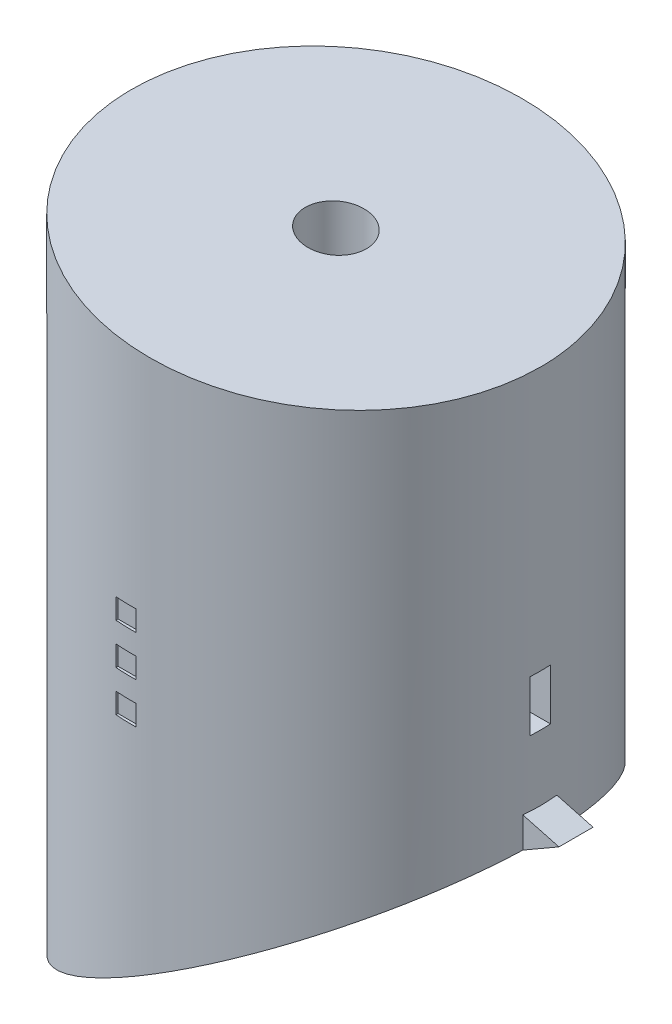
ISO-10303-21;
HEADER;
FILE_DESCRIPTION(('STEP AP214'),'2;1');
FILE_NAME('part.step','',(''),(''),'','','');
FILE_SCHEMA(('AUTOMOTIVE_DESIGN { 1 0 10303 214 1 1 1 1 }'));
ENDSEC;
DATA;
#1=APPLICATION_CONTEXT('core data for automotive mechanical design processes');
#2=APPLICATION_PROTOCOL_DEFINITION('international standard','automotive_design',2000,#1);
#3=PRODUCT_CONTEXT('',#1,'mechanical');
#4=PRODUCT('Part','Part','',(#3));
#5=PRODUCT_RELATED_PRODUCT_CATEGORY('part','',(#4));
#6=PRODUCT_DEFINITION_FORMATION('','',#4);
#7=PRODUCT_DEFINITION_CONTEXT('part definition',#1,'design');
#8=PRODUCT_DEFINITION('design','',#6,#7);
#9=PRODUCT_DEFINITION_SHAPE('','',#8);
#10=(LENGTH_UNIT() NAMED_UNIT(*) SI_UNIT(.MILLI.,.METRE.));
#11=(NAMED_UNIT(*) PLANE_ANGLE_UNIT() SI_UNIT($,.RADIAN.));
#12=(NAMED_UNIT(*) SI_UNIT($,.STERADIAN.) SOLID_ANGLE_UNIT());
#13=UNCERTAINTY_MEASURE_WITH_UNIT(LENGTH_MEASURE(1.E-05),#10,'distance_accuracy_value','');
#14=(GEOMETRIC_REPRESENTATION_CONTEXT(3) GLOBAL_UNCERTAINTY_ASSIGNED_CONTEXT((#13)) GLOBAL_UNIT_ASSIGNED_CONTEXT((#10,
#11,#12)) REPRESENTATION_CONTEXT('',''));
#15=CARTESIAN_POINT('',(0.,0.,0.));
#16=DIRECTION('',(0.,0.,1.));
#17=DIRECTION('',(1.,0.,0.));
#18=AXIS2_PLACEMENT_3D('',#15,#16,#17);
#19=CARTESIAN_POINT('',(0.,100.,0.));
#20=DIRECTION('',(0.,-1.,0.));
#21=DIRECTION('',(0.,0.,-1.));
#22=AXIS2_PLACEMENT_3D('',#19,#20,#21);
#23=CYLINDRICAL_SURFACE('',#22,30.);
#24=DIRECTION('',(0.,-1.,0.));
#25=VECTOR('',#24,1.);
#26=CARTESIAN_POINT('',(-2.36233387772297,100.,29.9068450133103));
#27=LINE('',#26,#25);
#28=CARTESIAN_POINT('',(-2.36233387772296,49.3500553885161,29.9068450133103));
#29=VERTEX_POINT('',#28);
#30=CARTESIAN_POINT('',(-2.36233387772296,52.3500553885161,29.9068450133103));
#31=VERTEX_POINT('',#30);
#32=EDGE_CURVE('E635',#29,#31,#27,.F.);
#33=ORIENTED_EDGE('',*,*,#32,.T.);
#34=CARTESIAN_POINT('',(0.,52.3500553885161,0.));
#35=DIRECTION('',(0.,1.,0.));
#36=DIRECTION('',(-1.,0.,0.));
#37=AXIS2_PLACEMENT_3D('',#34,#35,#36);
#38=CIRCLE('',#37,30.);
#39=CARTESIAN_POINT('',(0.637666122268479,52.3500553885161,29.993222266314));
#40=VERTEX_POINT('',#39);
#41=EDGE_CURVE('E626',#31,#40,#38,.T.);
#42=ORIENTED_EDGE('',*,*,#41,.T.);
#43=DIRECTION('',(0.,-1.,0.));
#44=VECTOR('',#43,1.);
#45=CARTESIAN_POINT('',(0.637666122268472,100.,29.993222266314));
#46=LINE('',#45,#44);
#47=CARTESIAN_POINT('',(0.637666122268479,49.3500553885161,29.993222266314));
#48=VERTEX_POINT('',#47);
#49=EDGE_CURVE('E632',#40,#48,#46,.T.);
#50=ORIENTED_EDGE('',*,*,#49,.T.);
#51=CARTESIAN_POINT('',(0.,49.3500553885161,0.));
#52=DIRECTION('',(0.,-1.,0.));
#53=DIRECTION('',(0.,0.,-1.));
#54=AXIS2_PLACEMENT_3D('',#51,#52,#53);
#55=CIRCLE('',#54,30.);
#56=EDGE_CURVE('E629',#48,#29,#55,.T.);
#57=ORIENTED_EDGE('',*,*,#56,.T.);
#58=EDGE_LOOP('',(#33,#42,#50,#57));
#59=FACE_BOUND('',#58,.T.);
#60=CARTESIAN_POINT('',(0.,64.3500553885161,0.));
#61=DIRECTION('',(0.,1.,0.));
#62=DIRECTION('',(0.,0.,1.));
#63=AXIS2_PLACEMENT_3D('',#60,#61,#62);
#64=CIRCLE('',#63,30.);
#65=CARTESIAN_POINT('',(-2.36233387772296,64.3500553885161,29.9068450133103));
#66=VERTEX_POINT('',#65);
#67=CARTESIAN_POINT('',(0.637666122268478,64.3500553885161,29.993222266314));
#68=VERTEX_POINT('',#67);
#69=EDGE_CURVE('E615',#66,#68,#64,.T.);
#70=ORIENTED_EDGE('',*,*,#69,.T.);
#71=DIRECTION('',(0.,-1.,0.));
#72=VECTOR('',#71,1.);
#73=CARTESIAN_POINT('',(0.637666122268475,100.,29.993222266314));
#74=LINE('',#73,#72);
#75=CARTESIAN_POINT('',(0.637666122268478,61.3500553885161,29.993222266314));
#76=VERTEX_POINT('',#75);
#77=EDGE_CURVE('E623',#68,#76,#74,.T.);
#78=ORIENTED_EDGE('',*,*,#77,.T.);
#79=CARTESIAN_POINT('',(0.,61.3500553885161,0.));
#80=DIRECTION('',(0.,-1.,0.));
#81=DIRECTION('',(0.,0.,-1.));
#82=AXIS2_PLACEMENT_3D('',#79,#80,#81);
#83=CIRCLE('',#82,30.);
#84=CARTESIAN_POINT('',(-2.36233387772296,61.3500553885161,29.9068450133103));
#85=VERTEX_POINT('',#84);
#86=EDGE_CURVE('E620',#76,#85,#83,.T.);
#87=ORIENTED_EDGE('',*,*,#86,.T.);
#88=DIRECTION('',(0.,-1.,0.));
#89=VECTOR('',#88,1.);
#90=CARTESIAN_POINT('',(-2.36233387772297,100.,29.9068450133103));
#91=LINE('',#90,#89);
#92=EDGE_CURVE('E617',#85,#66,#91,.F.);
#93=ORIENTED_EDGE('',*,*,#92,.T.);
#94=EDGE_LOOP('',(#70,#78,#87,#93));
#95=FACE_BOUND('',#94,.T.);
#96=CARTESIAN_POINT('',(0.,58.3500553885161,0.));
#97=DIRECTION('',(0.,1.,0.));
#98=DIRECTION('',(0.,0.,1.));
#99=AXIS2_PLACEMENT_3D('',#96,#97,#98);
#100=CIRCLE('',#99,30.);
#101=CARTESIAN_POINT('',(-2.36233387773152,58.3500553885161,29.9068450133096));
#102=VERTEX_POINT('',#101);
#103=CARTESIAN_POINT('',(0.637666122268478,58.3500553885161,29.993222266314));
#104=VERTEX_POINT('',#103);
#105=EDGE_CURVE('E604',#102,#104,#100,.T.);
#106=ORIENTED_EDGE('',*,*,#105,.T.);
#107=DIRECTION('',(0.,-1.,0.));
#108=VECTOR('',#107,1.);
#109=CARTESIAN_POINT('',(0.637666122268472,100.,29.993222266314));
#110=LINE('',#109,#108);
#111=CARTESIAN_POINT('',(0.637666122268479,55.3500553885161,29.993222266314));
#112=VERTEX_POINT('',#111);
#113=EDGE_CURVE('E612',#104,#112,#110,.T.);
#114=ORIENTED_EDGE('',*,*,#113,.T.);
#115=CARTESIAN_POINT('',(0.,55.3500553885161,0.));
#116=DIRECTION('',(0.,-1.,0.));
#117=DIRECTION('',(1.,0.,0.));
#118=AXIS2_PLACEMENT_3D('',#115,#116,#117);
#119=CIRCLE('',#118,30.);
#120=CARTESIAN_POINT('',(-2.36233387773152,55.3500553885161,29.9068450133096));
#121=VERTEX_POINT('',#120);
#122=EDGE_CURVE('E609',#112,#121,#119,.T.);
#123=ORIENTED_EDGE('',*,*,#122,.T.);
#124=DIRECTION('',(0.,-1.,0.));
#125=VECTOR('',#124,1.);
#126=CARTESIAN_POINT('',(-2.36233387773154,100.,29.9068450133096));
#127=LINE('',#126,#125);
#128=EDGE_CURVE('E606',#121,#102,#127,.F.);
#129=ORIENTED_EDGE('',*,*,#128,.T.);
#130=EDGE_LOOP('',(#106,#114,#123,#129));
#131=FACE_BOUND('',#130,.T.);
#132=CARTESIAN_POINT('',(0.,48.641016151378,0.));
#133=DIRECTION('',(0.,-1.,0.));
#134=DIRECTION('',(0.,0.,-1.));
#135=AXIS2_PLACEMENT_3D('',#132,#133,#134);
#136=CIRCLE('',#135,30.);
#137=CARTESIAN_POINT('',(29.9624765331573,48.641016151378,1.49999999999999));
#138=VERTEX_POINT('',#137);
#139=CARTESIAN_POINT('',(29.9624765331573,48.641016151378,-1.50000000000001));
#140=VERTEX_POINT('',#139);
#141=EDGE_CURVE('E422',#138,#140,#136,.F.);
#142=ORIENTED_EDGE('',*,*,#141,.F.);
#143=DIRECTION('',(0.,-1.,0.));
#144=VECTOR('',#143,1.);
#145=CARTESIAN_POINT('',(29.9624765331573,100.,1.5));
#146=LINE('',#145,#144);
#147=CARTESIAN_POINT('',(29.9624765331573,56.141016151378,1.5));
#148=VERTEX_POINT('',#147);
#149=EDGE_CURVE('E57',#148,#138,#146,.T.);
#150=ORIENTED_EDGE('',*,*,#149,.F.);
#151=CARTESIAN_POINT('',(0.,56.141016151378,0.));
#152=DIRECTION('',(0.,1.,0.));
#153=DIRECTION('',(0.,0.,1.));
#154=AXIS2_PLACEMENT_3D('',#151,#152,#153);
#155=CIRCLE('',#154,30.);
#156=CARTESIAN_POINT('',(29.9624765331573,56.141016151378,-1.5));
#157=VERTEX_POINT('',#156);
#158=EDGE_CURVE('E424',#157,#148,#155,.F.);
#159=ORIENTED_EDGE('',*,*,#158,.F.);
#160=DIRECTION('',(0.,-1.,0.));
#161=VECTOR('',#160,1.);
#162=CARTESIAN_POINT('',(29.9624765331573,100.,-1.5));
#163=LINE('',#162,#161);
#164=EDGE_CURVE('E427',#140,#157,#163,.F.);
#165=ORIENTED_EDGE('',*,*,#164,.F.);
#166=EDGE_LOOP('',(#142,#150,#159,#165));
#167=FACE_BOUND('',#166,.T.);
#168=CARTESIAN_POINT('',(0.,6.57534009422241,0.));
#169=DIRECTION('',(0.,1.,0.));
#170=DIRECTION('',(0.,0.,1.));
#171=AXIS2_PLACEMENT_3D('',#168,#169,#170);
#172=CIRCLE('',#171,30.);
#173=CARTESIAN_POINT('',(-29.9624765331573,6.57534009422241,-1.50000000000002));
#174=VERTEX_POINT('',#173);
#175=CARTESIAN_POINT('',(-29.9624765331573,6.57534009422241,1.50000000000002));
#176=VERTEX_POINT('',#175);
#177=EDGE_CURVE('E592',#174,#176,#172,.T.);
#178=ORIENTED_EDGE('',*,*,#177,.F.);
#179=DIRECTION('',(0.,-1.,0.));
#180=VECTOR('',#179,1.);
#181=CARTESIAN_POINT('',(-29.9624765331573,100.,-1.49999999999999));
#182=LINE('',#181,#180);
#183=CARTESIAN_POINT('',(-29.9624765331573,71.5753400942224,-1.5));
#184=VERTEX_POINT('',#183);
#185=EDGE_CURVE('E599',#184,#174,#182,.T.);
#186=ORIENTED_EDGE('',*,*,#185,.F.);
#187=CARTESIAN_POINT('',(0.,71.5753400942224,0.));
#188=DIRECTION('',(0.,-1.,0.));
#189=DIRECTION('',(0.,0.,-1.));
#190=AXIS2_PLACEMENT_3D('',#187,#188,#189);
#191=CIRCLE('',#190,30.);
#192=CARTESIAN_POINT('',(-29.9624765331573,71.5753400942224,1.5));
#193=VERTEX_POINT('',#192);
#194=EDGE_CURVE('E597',#193,#184,#191,.T.);
#195=ORIENTED_EDGE('',*,*,#194,.F.);
#196=DIRECTION('',(0.,-1.,0.));
#197=VECTOR('',#196,1.);
#198=CARTESIAN_POINT('',(-29.9624765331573,100.,1.49999999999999));
#199=LINE('',#198,#197);
#200=EDGE_CURVE('E594',#176,#193,#199,.F.);
#201=ORIENTED_EDGE('',*,*,#200,.F.);
#202=EDGE_LOOP('',(#178,#186,#195,#201));
#203=FACE_BOUND('',#202,.T.);
#204=CARTESIAN_POINT('',(-28.2842712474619,87.3753400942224,10.));
#205=CARTESIAN_POINT('',(-28.2842711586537,87.102998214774,10.0000001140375));
#206=CARTESIAN_POINT('',(-28.2882153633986,86.8306579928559,9.98886524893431));
#207=CARTESIAN_POINT('',(-28.303863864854,86.288019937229,9.94443775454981));
#208=CARTESIAN_POINT('',(-28.3155681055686,86.0177220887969,9.91114528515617));
#209=CARTESIAN_POINT('',(-28.3463631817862,85.4811190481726,9.82272262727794));
#210=CARTESIAN_POINT('',(-28.3654549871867,85.2148143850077,9.76758957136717));
#211=CARTESIAN_POINT('',(-28.4104260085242,84.6881175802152,9.63600126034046));
#212=CARTESIAN_POINT('',(-28.4363052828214,84.4277254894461,9.55954582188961));
#213=CARTESIAN_POINT('',(-28.4939998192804,83.9151751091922,9.38617562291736));
#214=CARTESIAN_POINT('',(-28.5258019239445,83.6629999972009,9.28930615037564));
#215=CARTESIAN_POINT('',(-28.594462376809,83.1677942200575,9.07575323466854));
#216=CARTESIAN_POINT('',(-28.6313226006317,82.924766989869,8.95906243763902));
#217=CARTESIAN_POINT('',(-28.7090513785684,82.4494272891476,8.70676649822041));
#218=CARTESIAN_POINT('',(-28.749919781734,82.2171144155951,8.57116206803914));
#219=CARTESIAN_POINT('',(-28.8345602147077,81.7645204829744,8.28195822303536));
#220=CARTESIAN_POINT('',(-28.8783324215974,81.5442401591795,8.12835771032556));
#221=CARTESIAN_POINT('',(-28.969218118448,81.1093676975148,7.79837866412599));
#222=CARTESIAN_POINT('',(-29.0163950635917,80.8952554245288,7.62138490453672));
#223=CARTESIAN_POINT('',(-29.1113399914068,80.482557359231,7.25028001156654));
#224=CARTESIAN_POINT('',(-29.1591079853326,80.2839718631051,7.05616855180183));
#225=CARTESIAN_POINT('',(-29.2539610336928,79.903513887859,6.65198113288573));
#226=CARTESIAN_POINT('',(-29.3010459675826,79.721644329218,6.44190239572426));
#227=CARTESIAN_POINT('',(-29.3932703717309,79.3758326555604,6.00708268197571));
#228=CARTESIAN_POINT('',(-29.4384099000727,79.2118900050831,5.78234214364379));
#229=CARTESIAN_POINT('',(-29.5266957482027,78.8989674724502,5.31343875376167));
#230=CARTESIAN_POINT('',(-29.5697580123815,78.7504967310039,5.06891983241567));
#231=CARTESIAN_POINT('',(-29.6513369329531,78.4748279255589,4.56756881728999));
#232=CARTESIAN_POINT('',(-29.6898553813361,78.3476214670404,4.31074163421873));
#233=CARTESIAN_POINT('',(-29.7612633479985,78.1154804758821,3.78644812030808));
#234=CARTESIAN_POINT('',(-29.7941528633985,78.0105459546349,3.51898178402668));
#235=CARTESIAN_POINT('',(-29.8533415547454,77.8239086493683,2.9753549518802));
#236=CARTESIAN_POINT('',(-29.8796410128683,77.7422048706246,2.69919482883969));
#237=CARTESIAN_POINT('',(-29.9240820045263,77.6052464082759,2.15001211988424));
#238=CARTESIAN_POINT('',(-29.9424755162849,77.5491704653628,1.87721461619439));
#239=CARTESIAN_POINT('',(-29.9718782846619,77.4599345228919,1.32750200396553));
#240=CARTESIAN_POINT('',(-29.982887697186,77.4267740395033,1.05058698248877));
#241=CARTESIAN_POINT('',(-29.997206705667,77.3837024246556,0.494817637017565));
#242=CARTESIAN_POINT('',(-30.0005180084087,77.3737861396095,0.215963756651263));
#243=CARTESIAN_POINT('',(-29.9993505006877,77.3772885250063,-0.341577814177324));
#244=CARTESIAN_POINT('',(-29.9948718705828,77.3907066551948,-0.620265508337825));
#245=CARTESIAN_POINT('',(-29.9785811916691,77.4397558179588,-1.16440400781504));
#246=CARTESIAN_POINT('',(-29.9670641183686,77.4744935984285,-1.42994475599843));
#247=CARTESIAN_POINT('',(-29.9372641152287,77.565059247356,-1.95700946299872));
#248=CARTESIAN_POINT('',(-29.9189813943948,77.6208864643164,-2.21853354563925));
#249=CARTESIAN_POINT('',(-29.8761277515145,77.753130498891,-2.73574967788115));
#250=CARTESIAN_POINT('',(-29.8515577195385,77.8295444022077,-2.99144254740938));
#251=CARTESIAN_POINT('',(-29.7967458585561,78.0023588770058,-3.49545812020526));
#252=CARTESIAN_POINT('',(-29.7665018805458,78.0987670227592,-3.74377798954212));
#253=CARTESIAN_POINT('',(-29.7006905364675,78.3121482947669,-4.2345072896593));
#254=CARTESIAN_POINT('',(-29.6650602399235,78.4293678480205,-4.47680106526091));
#255=CARTESIAN_POINT('',(-29.5896554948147,78.6826803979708,-4.95074703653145));
#256=CARTESIAN_POINT('',(-29.5498795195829,78.818780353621,-5.1823952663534));
#257=CARTESIAN_POINT('',(-29.467185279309,79.1088817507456,-5.63361428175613));
#258=CARTESIAN_POINT('',(-29.4242668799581,79.2628839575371,-5.85318455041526));
#259=CARTESIAN_POINT('',(-29.3363500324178,79.5877930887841,-6.2789999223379));
#260=CARTESIAN_POINT('',(-29.2913515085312,79.7587006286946,-6.4852445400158));
#261=CARTESIAN_POINT('',(-29.198230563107,80.1248588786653,-6.89268066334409));
#262=CARTESIAN_POINT('',(-29.150061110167,80.3208790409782,-7.09317055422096));
#263=CARTESIAN_POINT('',(-29.0539933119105,80.7290000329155,-7.47693750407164));
#264=CARTESIAN_POINT('',(-29.0060948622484,80.941094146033,-7.66022168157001));
#265=CARTESIAN_POINT('',(-28.911847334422,81.3802647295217,-8.00859996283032));
#266=CARTESIAN_POINT('',(-28.8654991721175,81.6073498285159,-8.17368344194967));
#267=CARTESIAN_POINT('',(-28.775718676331,82.0749070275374,-8.4843478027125));
#268=CARTESIAN_POINT('',(-28.7322851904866,82.3153737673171,-8.62993641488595));
#269=CARTESIAN_POINT('',(-28.64898095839,82.8119121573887,-8.90261331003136));
#270=CARTESIAN_POINT('',(-28.6091721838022,83.0681616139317,-9.02939717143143));
#271=CARTESIAN_POINT('',(-28.5351208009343,83.5911515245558,-9.2607580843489));
#272=CARTESIAN_POINT('',(-28.5008758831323,83.8578875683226,-9.36534435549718));
#273=CARTESIAN_POINT('',(-28.439058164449,84.4000205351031,-9.55141833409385));
#274=CARTESIAN_POINT('',(-28.4114845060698,84.6754163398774,-9.63290901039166));
#275=CARTESIAN_POINT('',(-28.3639441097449,85.2328166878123,-9.77200545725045));
#276=CARTESIAN_POINT('',(-28.3439769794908,85.5148208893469,-9.8296124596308));
#277=CARTESIAN_POINT('',(-28.3130630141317,86.0703666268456,-9.9182943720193));
#278=CARTESIAN_POINT('',(-28.3017497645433,86.3437157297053,-9.95044933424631));
#279=CARTESIAN_POINT('',(-28.287066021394,86.892345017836,-9.99211639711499));
#280=CARTESIAN_POINT('',(-28.2836952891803,87.1676251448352,-10.0016291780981));
#281=CARTESIAN_POINT('',(-28.2850080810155,87.7179660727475,-9.9979157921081));
#282=CARTESIAN_POINT('',(-28.2896902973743,87.9930269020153,-9.98469331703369));
#283=CARTESIAN_POINT('',(-28.3069515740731,88.5408725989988,-9.9356512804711));
#284=CARTESIAN_POINT('',(-28.3195305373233,88.8136574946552,-9.89983199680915));
#285=CARTESIAN_POINT('',(-28.3516074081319,89.3455358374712,-9.80758102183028));
#286=CARTESIAN_POINT('',(-28.3708507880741,89.6047763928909,-9.75190561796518));
#287=CARTESIAN_POINT('',(-28.4157468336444,90.1175905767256,-9.62029948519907));
#288=CARTESIAN_POINT('',(-28.4414017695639,90.3711621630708,-9.54436158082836));
#289=CARTESIAN_POINT('',(-28.4983692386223,90.8708601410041,-9.37289185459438));
#290=CARTESIAN_POINT('',(-28.529680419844,91.1169882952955,-9.27736471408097));
#291=CARTESIAN_POINT('',(-28.597103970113,91.600466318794,-9.0674030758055));
#292=CARTESIAN_POINT('',(-28.6332181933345,91.8378127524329,-8.95296127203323));
#293=CARTESIAN_POINT('',(-28.710459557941,92.3095386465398,-8.70214104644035));
#294=CARTESIAN_POINT('',(-28.7517082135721,92.5435927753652,-8.56518817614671));
#295=CARTESIAN_POINT('',(-28.8371535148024,92.9995382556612,-8.27295319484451));
#296=CARTESIAN_POINT('',(-28.8813514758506,93.2214240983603,-8.1176628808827));
#297=CARTESIAN_POINT('',(-28.9715031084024,93.6516644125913,-7.78979500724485));
#298=CARTESIAN_POINT('',(-29.0174568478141,93.8600183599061,-7.61721677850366));
#299=CARTESIAN_POINT('',(-29.1099265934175,94.2620007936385,-7.25582239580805));
#300=CARTESIAN_POINT('',(-29.1564426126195,94.4556289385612,-7.06700586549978));
#301=CARTESIAN_POINT('',(-29.2510891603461,94.8360224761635,-6.66472112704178));
#302=CARTESIAN_POINT('',(-29.2991889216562,95.0220026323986,-6.45050221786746));
#303=CARTESIAN_POINT('',(-29.3933527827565,95.3752251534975,-6.00684695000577));
#304=CARTESIAN_POINT('',(-29.4394176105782,95.5424742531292,-5.77741610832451));
#305=CARTESIAN_POINT('',(-29.5282725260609,95.8571842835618,-5.30461980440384));
#306=CARTESIAN_POINT('',(-29.5710613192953,96.004637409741,-5.06124889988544));
#307=CARTESIAN_POINT('',(-29.6521306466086,96.2784831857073,-4.56234364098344));
#308=CARTESIAN_POINT('',(-29.6904130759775,96.4048846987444,-4.30681446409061));
#309=CARTESIAN_POINT('',(-29.7611781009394,96.6349095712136,-3.78690590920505));
#310=CARTESIAN_POINT('',(-29.7936962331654,96.7386734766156,-3.52259360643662));
#311=CARTESIAN_POINT('',(-29.8523040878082,96.9235205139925,-2.98545108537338));
#312=CARTESIAN_POINT('',(-29.8783938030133,97.0046036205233,-2.71262085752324));
#313=CARTESIAN_POINT('',(-29.9233798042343,97.1432961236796,-2.16055813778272));
#314=CARTESIAN_POINT('',(-29.9422782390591,97.200912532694,-1.88132758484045));
#315=CARTESIAN_POINT('',(-29.9723335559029,97.2921258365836,-1.31856201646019));
#316=CARTESIAN_POINT('',(-29.983490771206,97.3257237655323,-1.03502718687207));
#317=CARTESIAN_POINT('',(-29.9973972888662,97.3675473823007,-0.47931926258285));
#318=CARTESIAN_POINT('',(-30.0005173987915,97.3768921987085,-0.207239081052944));
#319=CARTESIAN_POINT('',(-29.9993428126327,97.3733686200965,0.336755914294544));
#320=CARTESIAN_POINT('',(-29.9950483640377,97.3605009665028,0.608670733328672));
#321=CARTESIAN_POINT('',(-29.9791626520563,97.312678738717,1.15030993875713));
#322=CARTESIAN_POINT('',(-29.9675719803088,97.2777259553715,1.42003450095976));
#323=CARTESIAN_POINT('',(-29.9374086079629,97.1860640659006,1.95536187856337));
#324=CARTESIAN_POINT('',(-29.9188358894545,97.1293549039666,2.22096468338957));
#325=CARTESIAN_POINT('',(-29.8755584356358,96.9957825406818,2.74194020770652));
#326=CARTESIAN_POINT('',(-29.8509573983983,96.9192590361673,2.99740882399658));
#327=CARTESIAN_POINT('',(-29.7960968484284,96.7462587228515,3.50096941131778));
#328=CARTESIAN_POINT('',(-29.7658353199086,96.64977480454,3.74905871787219));
#329=CARTESIAN_POINT('',(-29.7004207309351,96.4376337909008,4.23620216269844));
#330=CARTESIAN_POINT('',(-29.6652680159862,96.321978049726,4.47525693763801));
#331=CARTESIAN_POINT('',(-29.5909339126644,96.0723261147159,4.94294527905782));
#332=CARTESIAN_POINT('',(-29.551752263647,95.9383287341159,5.1715781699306));
#333=CARTESIAN_POINT('',(-29.4688081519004,95.647629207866,5.62534353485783));
#334=CARTESIAN_POINT('',(-29.4249299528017,95.4902712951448,5.85003487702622));
#335=CARTESIAN_POINT('',(-29.3350010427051,95.1578769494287,6.2854712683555));
#336=CARTESIAN_POINT('',(-29.2889502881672,94.9828401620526,6.49621603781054));
#337=CARTESIAN_POINT('',(-29.1958514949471,94.6161409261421,6.90258840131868));
#338=CARTESIAN_POINT('',(-29.148803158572,94.4244734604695,7.09821139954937));
#339=CARTESIAN_POINT('',(-29.0549477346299,94.0257183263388,7.47310912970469));
#340=CARTESIAN_POINT('',(-29.0081406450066,93.8186307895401,7.6523840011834));
#341=CARTESIAN_POINT('',(-28.914186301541,93.3817893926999,8.00022249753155));
#342=CARTESIAN_POINT('',(-28.8670984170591,93.1514637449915,8.16808498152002));
#343=CARTESIAN_POINT('',(-28.7759175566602,92.6770000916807,8.48372301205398));
#344=CARTESIAN_POINT('',(-28.7318234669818,92.4328672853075,8.63150604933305));
#345=CARTESIAN_POINT('',(-28.6479466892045,91.9322823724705,8.90593894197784));
#346=CARTESIAN_POINT('',(-28.6081640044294,91.6758302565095,9.03258878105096));
#347=CARTESIAN_POINT('',(-28.5341661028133,91.1523427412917,9.26369799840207));
#348=CARTESIAN_POINT('',(-28.4999505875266,90.88530791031,9.36815856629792));
#349=CARTESIAN_POINT('',(-28.439603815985,90.3548255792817,9.54974733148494));
#350=CARTESIAN_POINT('',(-28.4131771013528,90.0917613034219,9.62789736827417));
#351=CARTESIAN_POINT('',(-28.3672416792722,89.5595266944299,9.76241059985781));
#352=CARTESIAN_POINT('',(-28.3477327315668,89.2903565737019,9.8187745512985));
#353=CARTESIAN_POINT('',(-28.3162626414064,88.7479324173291,9.90916574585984));
#354=CARTESIAN_POINT('',(-28.304299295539,88.4746795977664,9.94319950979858));
#355=CARTESIAN_POINT('',(-28.2883036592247,87.9260639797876,9.98861653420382));
#356=CARTESIAN_POINT('',(-28.2842713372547,87.6507011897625,9.99999988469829));
#357=CARTESIAN_POINT('',(-28.2842712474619,87.3753400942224,10.));
#358=B_SPLINE_CURVE_WITH_KNOTS('',3,(#204,#205,#206,#207,#208,#209,#210,#211,#212,#213,#214,
#215,#216,#217,#218,#219,#220,#221,#222,#223,#224,#225,#226,#227,#228,#229,#230,#231,#232,#233,
#234,#235,#236,#237,#238,#239,#240,#241,#242,#243,#244,#245,#246,#247,#248,#249,#250,#251,#252,
#253,#254,#255,#256,#257,#258,#259,#260,#261,#262,#263,#264,#265,#266,#267,#268,#269,#270,#271,
#272,#273,#274,#275,#276,#277,#278,#279,#280,#281,#282,#283,#284,#285,#286,#287,#288,#289,#290,
#291,#292,#293,#294,#295,#296,#297,#298,#299,#300,#301,#302,#303,#304,#305,#306,#307,#308,#309,
#310,#311,#312,#313,#314,#315,#316,#317,#318,#319,#320,#321,#322,#323,#324,#325,#326,#327,#328,
#329,#330,#331,#332,#333,#334,#335,#336,#337,#338,#339,#340,#341,#342,#343,#344,#345,#346,#347,
#348,#349,#350,#351,#352,#353,#354,#355,#356,#357),.UNSPECIFIED.,.T.,.F.,(4,2,2,2,2,2,2,2,2,2,2,
2,2,2,2,2,2,2,2,2,2,2,2,2,2,2,2,2,2,2,2,2,2,2,2,2,2,2,2,2,2,2,2,2,2,2,2,2,2,2,2,2,2,2,2,2,2,2,2,
2,2,2,2,2,2,2,2,2,2,2,2,2,2,2,2,2,4),(0.,0.8167680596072,1.63353022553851,2.4503996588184,
3.26727611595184,4.08235908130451,4.89774511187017,5.71310044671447,6.52850554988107,
7.37286999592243,8.21725054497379,9.06177833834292,9.90628089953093,10.7730733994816,
11.6395229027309,12.5059728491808,13.3723856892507,14.208656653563,15.0449099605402,
15.8809778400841,16.7170263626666,17.5202339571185,18.3234167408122,19.1264858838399,
19.9298598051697,20.74347212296,21.5573851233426,22.3713329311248,23.1853103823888,
24.0378278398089,24.889991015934,25.7426490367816,26.5949679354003,27.459853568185,
28.3243792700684,29.1887937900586,30.0531637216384,30.8785251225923,31.7038617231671,
32.5290643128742,33.3542567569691,34.1508897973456,34.9478053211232,35.7445306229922,
36.5415643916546,37.3635426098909,38.1858899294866,39.0082690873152,39.8306673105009,
40.6928533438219,41.5547283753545,42.4169422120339,43.2787921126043,44.1351284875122,
44.9914658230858,45.8475470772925,46.7035914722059,47.5193689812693,48.3351192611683,
49.1508034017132,49.9664896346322,50.7690241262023,51.5718449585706,52.3746091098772,
53.1774252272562,54.009891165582,54.8423737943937,55.6751084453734,56.507835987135,
57.3734004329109,58.2386410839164,59.1038824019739,59.9690773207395,60.795173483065,
61.6212409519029,62.44706708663,63.2728899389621),.UNSPECIFIED.);
#359=CARTESIAN_POINT('',(-30.,77.3753400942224,0.));
#360=VERTEX_POINT('',#359);
#361=CARTESIAN_POINT('',(-30.,97.3753400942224,0.));
#362=VERTEX_POINT('',#361);
#363=EDGE_CURVE('E506',#360,#362,#358,.T.);
#364=ORIENTED_EDGE('',*,*,#363,.T.);
#365=CARTESIAN_POINT('',(-28.2842712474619,87.3753400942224,10.));
#366=CARTESIAN_POINT('',(-28.2842711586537,87.102998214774,10.0000001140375));
#367=CARTESIAN_POINT('',(-28.2882153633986,86.8306579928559,9.98886524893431));
#368=CARTESIAN_POINT('',(-28.303863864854,86.288019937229,9.94443775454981));
#369=CARTESIAN_POINT('',(-28.3155681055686,86.0177220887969,9.91114528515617));
#370=CARTESIAN_POINT('',(-28.3463631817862,85.4811190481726,9.82272262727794));
#371=CARTESIAN_POINT('',(-28.3654549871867,85.2148143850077,9.76758957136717));
#372=CARTESIAN_POINT('',(-28.4104260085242,84.6881175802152,9.63600126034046));
#373=CARTESIAN_POINT('',(-28.4363052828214,84.4277254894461,9.55954582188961));
#374=CARTESIAN_POINT('',(-28.4939998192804,83.9151751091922,9.38617562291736));
#375=CARTESIAN_POINT('',(-28.5258019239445,83.6629999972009,9.28930615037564));
#376=CARTESIAN_POINT('',(-28.594462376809,83.1677942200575,9.07575323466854));
#377=CARTESIAN_POINT('',(-28.6313226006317,82.924766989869,8.95906243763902));
#378=CARTESIAN_POINT('',(-28.7090513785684,82.4494272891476,8.70676649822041));
#379=CARTESIAN_POINT('',(-28.749919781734,82.2171144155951,8.57116206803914));
#380=CARTESIAN_POINT('',(-28.8345602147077,81.7645204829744,8.28195822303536));
#381=CARTESIAN_POINT('',(-28.8783324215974,81.5442401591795,8.12835771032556));
#382=CARTESIAN_POINT('',(-28.969218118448,81.1093676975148,7.79837866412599));
#383=CARTESIAN_POINT('',(-29.0163950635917,80.8952554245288,7.62138490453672));
#384=CARTESIAN_POINT('',(-29.1113399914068,80.482557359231,7.25028001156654));
#385=CARTESIAN_POINT('',(-29.1591079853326,80.2839718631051,7.05616855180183));
#386=CARTESIAN_POINT('',(-29.2539610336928,79.903513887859,6.65198113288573));
#387=CARTESIAN_POINT('',(-29.3010459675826,79.721644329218,6.44190239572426));
#388=CARTESIAN_POINT('',(-29.3932703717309,79.3758326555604,6.00708268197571));
#389=CARTESIAN_POINT('',(-29.4384099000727,79.2118900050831,5.78234214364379));
#390=CARTESIAN_POINT('',(-29.5266957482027,78.8989674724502,5.31343875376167));
#391=CARTESIAN_POINT('',(-29.5697580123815,78.7504967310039,5.06891983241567));
#392=CARTESIAN_POINT('',(-29.6513369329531,78.4748279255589,4.56756881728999));
#393=CARTESIAN_POINT('',(-29.6898553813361,78.3476214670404,4.31074163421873));
#394=CARTESIAN_POINT('',(-29.7612633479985,78.1154804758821,3.78644812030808));
#395=CARTESIAN_POINT('',(-29.7941528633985,78.0105459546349,3.51898178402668));
#396=CARTESIAN_POINT('',(-29.8533415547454,77.8239086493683,2.9753549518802));
#397=CARTESIAN_POINT('',(-29.8796410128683,77.7422048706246,2.69919482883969));
#398=CARTESIAN_POINT('',(-29.9240820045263,77.6052464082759,2.15001211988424));
#399=CARTESIAN_POINT('',(-29.9424755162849,77.5491704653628,1.87721461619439));
#400=CARTESIAN_POINT('',(-29.9718782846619,77.4599345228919,1.32750200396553));
#401=CARTESIAN_POINT('',(-29.982887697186,77.4267740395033,1.05058698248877));
#402=CARTESIAN_POINT('',(-29.997206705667,77.3837024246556,0.494817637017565));
#403=CARTESIAN_POINT('',(-30.0005180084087,77.3737861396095,0.215963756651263));
#404=CARTESIAN_POINT('',(-29.9993505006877,77.3772885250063,-0.341577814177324));
#405=CARTESIAN_POINT('',(-29.9948718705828,77.3907066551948,-0.620265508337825));
#406=CARTESIAN_POINT('',(-29.9785811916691,77.4397558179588,-1.16440400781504));
#407=CARTESIAN_POINT('',(-29.9670641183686,77.4744935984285,-1.42994475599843));
#408=CARTESIAN_POINT('',(-29.9372641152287,77.565059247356,-1.95700946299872));
#409=CARTESIAN_POINT('',(-29.9189813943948,77.6208864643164,-2.21853354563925));
#410=CARTESIAN_POINT('',(-29.8761277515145,77.753130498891,-2.73574967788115));
#411=CARTESIAN_POINT('',(-29.8515577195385,77.8295444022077,-2.99144254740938));
#412=CARTESIAN_POINT('',(-29.7967458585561,78.0023588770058,-3.49545812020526));
#413=CARTESIAN_POINT('',(-29.7665018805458,78.0987670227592,-3.74377798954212));
#414=CARTESIAN_POINT('',(-29.7006905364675,78.3121482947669,-4.2345072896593));
#415=CARTESIAN_POINT('',(-29.6650602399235,78.4293678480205,-4.47680106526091));
#416=CARTESIAN_POINT('',(-29.5896554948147,78.6826803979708,-4.95074703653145));
#417=CARTESIAN_POINT('',(-29.5498795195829,78.818780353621,-5.1823952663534));
#418=CARTESIAN_POINT('',(-29.467185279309,79.1088817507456,-5.63361428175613));
#419=CARTESIAN_POINT('',(-29.4242668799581,79.2628839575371,-5.85318455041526));
#420=CARTESIAN_POINT('',(-29.3363500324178,79.5877930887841,-6.2789999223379));
#421=CARTESIAN_POINT('',(-29.2913515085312,79.7587006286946,-6.4852445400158));
#422=CARTESIAN_POINT('',(-29.198230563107,80.1248588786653,-6.89268066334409));
#423=CARTESIAN_POINT('',(-29.150061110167,80.3208790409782,-7.09317055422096));
#424=CARTESIAN_POINT('',(-29.0539933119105,80.7290000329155,-7.47693750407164));
#425=CARTESIAN_POINT('',(-29.0060948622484,80.941094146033,-7.66022168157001));
#426=CARTESIAN_POINT('',(-28.911847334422,81.3802647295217,-8.00859996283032));
#427=CARTESIAN_POINT('',(-28.8654991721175,81.6073498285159,-8.17368344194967));
#428=CARTESIAN_POINT('',(-28.775718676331,82.0749070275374,-8.4843478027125));
#429=CARTESIAN_POINT('',(-28.7322851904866,82.3153737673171,-8.62993641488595));
#430=CARTESIAN_POINT('',(-28.64898095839,82.8119121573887,-8.90261331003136));
#431=CARTESIAN_POINT('',(-28.6091721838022,83.0681616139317,-9.02939717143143));
#432=CARTESIAN_POINT('',(-28.5351208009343,83.5911515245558,-9.2607580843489));
#433=CARTESIAN_POINT('',(-28.5008758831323,83.8578875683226,-9.36534435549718));
#434=CARTESIAN_POINT('',(-28.439058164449,84.4000205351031,-9.55141833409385));
#435=CARTESIAN_POINT('',(-28.4114845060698,84.6754163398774,-9.63290901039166));
#436=CARTESIAN_POINT('',(-28.3639441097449,85.2328166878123,-9.77200545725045));
#437=CARTESIAN_POINT('',(-28.3439769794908,85.5148208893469,-9.8296124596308));
#438=CARTESIAN_POINT('',(-28.3130630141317,86.0703666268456,-9.9182943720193));
#439=CARTESIAN_POINT('',(-28.3017497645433,86.3437157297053,-9.95044933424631));
#440=CARTESIAN_POINT('',(-28.287066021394,86.892345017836,-9.99211639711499));
#441=CARTESIAN_POINT('',(-28.2836952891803,87.1676251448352,-10.0016291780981));
#442=CARTESIAN_POINT('',(-28.2850080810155,87.7179660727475,-9.9979157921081));
#443=CARTESIAN_POINT('',(-28.2896902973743,87.9930269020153,-9.98469331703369));
#444=CARTESIAN_POINT('',(-28.3069515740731,88.5408725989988,-9.9356512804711));
#445=CARTESIAN_POINT('',(-28.3195305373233,88.8136574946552,-9.89983199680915));
#446=CARTESIAN_POINT('',(-28.3516074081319,89.3455358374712,-9.80758102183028));
#447=CARTESIAN_POINT('',(-28.3708507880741,89.6047763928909,-9.75190561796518));
#448=CARTESIAN_POINT('',(-28.4157468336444,90.1175905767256,-9.62029948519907));
#449=CARTESIAN_POINT('',(-28.4414017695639,90.3711621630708,-9.54436158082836));
#450=CARTESIAN_POINT('',(-28.4983692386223,90.8708601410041,-9.37289185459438));
#451=CARTESIAN_POINT('',(-28.529680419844,91.1169882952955,-9.27736471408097));
#452=CARTESIAN_POINT('',(-28.597103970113,91.600466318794,-9.0674030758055));
#453=CARTESIAN_POINT('',(-28.6332181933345,91.8378127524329,-8.95296127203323));
#454=CARTESIAN_POINT('',(-28.710459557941,92.3095386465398,-8.70214104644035));
#455=CARTESIAN_POINT('',(-28.7517082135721,92.5435927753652,-8.56518817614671));
#456=CARTESIAN_POINT('',(-28.8371535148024,92.9995382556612,-8.27295319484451));
#457=CARTESIAN_POINT('',(-28.8813514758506,93.2214240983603,-8.1176628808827));
#458=CARTESIAN_POINT('',(-28.9715031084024,93.6516644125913,-7.78979500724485));
#459=CARTESIAN_POINT('',(-29.0174568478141,93.8600183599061,-7.61721677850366));
#460=CARTESIAN_POINT('',(-29.1099265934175,94.2620007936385,-7.25582239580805));
#461=CARTESIAN_POINT('',(-29.1564426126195,94.4556289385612,-7.06700586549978));
#462=CARTESIAN_POINT('',(-29.2510891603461,94.8360224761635,-6.66472112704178));
#463=CARTESIAN_POINT('',(-29.2991889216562,95.0220026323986,-6.45050221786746));
#464=CARTESIAN_POINT('',(-29.3933527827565,95.3752251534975,-6.00684695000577));
#465=CARTESIAN_POINT('',(-29.4394176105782,95.5424742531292,-5.77741610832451));
#466=CARTESIAN_POINT('',(-29.5282725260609,95.8571842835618,-5.30461980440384));
#467=CARTESIAN_POINT('',(-29.5710613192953,96.004637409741,-5.06124889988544));
#468=CARTESIAN_POINT('',(-29.6521306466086,96.2784831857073,-4.56234364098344));
#469=CARTESIAN_POINT('',(-29.6904130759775,96.4048846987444,-4.30681446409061));
#470=CARTESIAN_POINT('',(-29.7611781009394,96.6349095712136,-3.78690590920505));
#471=CARTESIAN_POINT('',(-29.7936962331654,96.7386734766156,-3.52259360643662));
#472=CARTESIAN_POINT('',(-29.8523040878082,96.9235205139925,-2.98545108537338));
#473=CARTESIAN_POINT('',(-29.8783938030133,97.0046036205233,-2.71262085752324));
#474=CARTESIAN_POINT('',(-29.9233798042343,97.1432961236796,-2.16055813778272));
#475=CARTESIAN_POINT('',(-29.9422782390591,97.200912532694,-1.88132758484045));
#476=CARTESIAN_POINT('',(-29.9723335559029,97.2921258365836,-1.31856201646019));
#477=CARTESIAN_POINT('',(-29.983490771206,97.3257237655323,-1.03502718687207));
#478=CARTESIAN_POINT('',(-29.9973972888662,97.3675473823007,-0.47931926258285));
#479=CARTESIAN_POINT('',(-30.0005173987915,97.3768921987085,-0.207239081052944));
#480=CARTESIAN_POINT('',(-29.9993428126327,97.3733686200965,0.336755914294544));
#481=CARTESIAN_POINT('',(-29.9950483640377,97.3605009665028,0.608670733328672));
#482=CARTESIAN_POINT('',(-29.9791626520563,97.312678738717,1.15030993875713));
#483=CARTESIAN_POINT('',(-29.9675719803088,97.2777259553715,1.42003450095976));
#484=CARTESIAN_POINT('',(-29.9374086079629,97.1860640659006,1.95536187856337));
#485=CARTESIAN_POINT('',(-29.9188358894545,97.1293549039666,2.22096468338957));
#486=CARTESIAN_POINT('',(-29.8755584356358,96.9957825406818,2.74194020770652));
#487=CARTESIAN_POINT('',(-29.8509573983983,96.9192590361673,2.99740882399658));
#488=CARTESIAN_POINT('',(-29.7960968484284,96.7462587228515,3.50096941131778));
#489=CARTESIAN_POINT('',(-29.7658353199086,96.64977480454,3.74905871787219));
#490=CARTESIAN_POINT('',(-29.7004207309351,96.4376337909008,4.23620216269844));
#491=CARTESIAN_POINT('',(-29.6652680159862,96.321978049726,4.47525693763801));
#492=CARTESIAN_POINT('',(-29.5909339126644,96.0723261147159,4.94294527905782));
#493=CARTESIAN_POINT('',(-29.551752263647,95.9383287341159,5.1715781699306));
#494=CARTESIAN_POINT('',(-29.4688081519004,95.647629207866,5.62534353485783));
#495=CARTESIAN_POINT('',(-29.4249299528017,95.4902712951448,5.85003487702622));
#496=CARTESIAN_POINT('',(-29.3350010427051,95.1578769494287,6.2854712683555));
#497=CARTESIAN_POINT('',(-29.2889502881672,94.9828401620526,6.49621603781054));
#498=CARTESIAN_POINT('',(-29.1958514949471,94.6161409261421,6.90258840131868));
#499=CARTESIAN_POINT('',(-29.148803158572,94.4244734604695,7.09821139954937));
#500=CARTESIAN_POINT('',(-29.0549477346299,94.0257183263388,7.47310912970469));
#501=CARTESIAN_POINT('',(-29.0081406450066,93.8186307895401,7.6523840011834));
#502=CARTESIAN_POINT('',(-28.914186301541,93.3817893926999,8.00022249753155));
#503=CARTESIAN_POINT('',(-28.8670984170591,93.1514637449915,8.16808498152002));
#504=CARTESIAN_POINT('',(-28.7759175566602,92.6770000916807,8.48372301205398));
#505=CARTESIAN_POINT('',(-28.7318234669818,92.4328672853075,8.63150604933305));
#506=CARTESIAN_POINT('',(-28.6479466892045,91.9322823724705,8.90593894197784));
#507=CARTESIAN_POINT('',(-28.6081640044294,91.6758302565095,9.03258878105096));
#508=CARTESIAN_POINT('',(-28.5341661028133,91.1523427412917,9.26369799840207));
#509=CARTESIAN_POINT('',(-28.4999505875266,90.88530791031,9.36815856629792));
#510=CARTESIAN_POINT('',(-28.439603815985,90.3548255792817,9.54974733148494));
#511=CARTESIAN_POINT('',(-28.4131771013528,90.0917613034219,9.62789736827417));
#512=CARTESIAN_POINT('',(-28.3672416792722,89.5595266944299,9.76241059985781));
#513=CARTESIAN_POINT('',(-28.3477327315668,89.2903565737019,9.8187745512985));
#514=CARTESIAN_POINT('',(-28.3162626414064,88.7479324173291,9.90916574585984));
#515=CARTESIAN_POINT('',(-28.304299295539,88.4746795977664,9.94319950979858));
#516=CARTESIAN_POINT('',(-28.2883036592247,87.9260639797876,9.98861653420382));
#517=CARTESIAN_POINT('',(-28.2842713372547,87.6507011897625,9.99999988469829));
#518=CARTESIAN_POINT('',(-28.2842712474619,87.3753400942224,10.));
#519=B_SPLINE_CURVE_WITH_KNOTS('',3,(#365,#366,#367,#368,#369,#370,#371,#372,#373,#374,#375,
#376,#377,#378,#379,#380,#381,#382,#383,#384,#385,#386,#387,#388,#389,#390,#391,#392,#393,#394,
#395,#396,#397,#398,#399,#400,#401,#402,#403,#404,#405,#406,#407,#408,#409,#410,#411,#412,#413,
#414,#415,#416,#417,#418,#419,#420,#421,#422,#423,#424,#425,#426,#427,#428,#429,#430,#431,#432,
#433,#434,#435,#436,#437,#438,#439,#440,#441,#442,#443,#444,#445,#446,#447,#448,#449,#450,#451,
#452,#453,#454,#455,#456,#457,#458,#459,#460,#461,#462,#463,#464,#465,#466,#467,#468,#469,#470,
#471,#472,#473,#474,#475,#476,#477,#478,#479,#480,#481,#482,#483,#484,#485,#486,#487,#488,#489,
#490,#491,#492,#493,#494,#495,#496,#497,#498,#499,#500,#501,#502,#503,#504,#505,#506,#507,#508,
#509,#510,#511,#512,#513,#514,#515,#516,#517,#518),.UNSPECIFIED.,.T.,.F.,(4,2,2,2,2,2,2,2,2,2,2,
2,2,2,2,2,2,2,2,2,2,2,2,2,2,2,2,2,2,2,2,2,2,2,2,2,2,2,2,2,2,2,2,2,2,2,2,2,2,2,2,2,2,2,2,2,2,2,2,
2,2,2,2,2,2,2,2,2,2,2,2,2,2,2,2,2,4),(0.,0.8167680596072,1.63353022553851,2.4503996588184,
3.26727611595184,4.08235908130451,4.89774511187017,5.71310044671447,6.52850554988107,
7.37286999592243,8.21725054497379,9.06177833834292,9.90628089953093,10.7730733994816,
11.6395229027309,12.5059728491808,13.3723856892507,14.208656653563,15.0449099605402,
15.8809778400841,16.7170263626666,17.5202339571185,18.3234167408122,19.1264858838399,
19.9298598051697,20.74347212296,21.5573851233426,22.3713329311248,23.1853103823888,
24.0378278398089,24.889991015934,25.7426490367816,26.5949679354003,27.459853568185,
28.3243792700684,29.1887937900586,30.0531637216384,30.8785251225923,31.7038617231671,
32.5290643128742,33.3542567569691,34.1508897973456,34.9478053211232,35.7445306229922,
36.5415643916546,37.3635426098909,38.1858899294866,39.0082690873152,39.8306673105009,
40.6928533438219,41.5547283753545,42.4169422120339,43.2787921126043,44.1351284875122,
44.9914658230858,45.8475470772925,46.7035914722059,47.5193689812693,48.3351192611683,
49.1508034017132,49.9664896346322,50.7690241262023,51.5718449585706,52.3746091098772,
53.1774252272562,54.009891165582,54.8423737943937,55.6751084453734,56.507835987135,
57.3734004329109,58.2386410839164,59.1038824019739,59.9690773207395,60.795173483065,
61.6212409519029,62.44706708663,63.2728899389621),.UNSPECIFIED.);
#520=EDGE_CURVE('E517',#362,#360,#519,.T.);
#521=ORIENTED_EDGE('',*,*,#520,.T.);
#522=EDGE_LOOP('',(#364,#521));
#523=FACE_BOUND('',#522,.T.);
#524=CARTESIAN_POINT('',(0.,97.3753400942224,0.));
#525=DIRECTION('',(-0.0871557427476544,-0.996194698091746,0.));
#526=DIRECTION('',(0.996194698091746,-0.0871557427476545,0.));
#527=AXIS2_PLACEMENT_3D('',#524,#525,#526);
#528=ELLIPSE('',#527,30.1145951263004,30.);
#529=CARTESIAN_POINT('',(30.,94.7506801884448,0.));
#530=VERTEX_POINT('',#529);
#531=EDGE_CURVE('E583',#530,#530,#528,.T.);
#532=ORIENTED_EDGE('',*,*,#531,.T.);
#533=EDGE_LOOP('',(#532));
#534=FACE_BOUND('',#533,.T.);
#535=DIRECTION('',(0.,-1.,0.));
#536=VECTOR('',#535,1.);
#537=CARTESIAN_POINT('',(29.8956518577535,100.,2.5));
#538=LINE('',#537,#536);
#539=CARTESIAN_POINT('',(29.8956518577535,39.0612809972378,2.5));
#540=VERTEX_POINT('',#539);
#541=CARTESIAN_POINT('',(29.8956518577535,34.5807707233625,2.5));
#542=VERTEX_POINT('',#541);
#543=EDGE_CURVE('E458',#540,#542,#538,.T.);
#544=ORIENTED_EDGE('',*,*,#543,.F.);
#545=CARTESIAN_POINT('',(0.,47.0717967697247,0.));
#546=DIRECTION('',(-0.258819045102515,-0.96592582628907,0.));
#547=DIRECTION('',(0.96592582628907,-0.258819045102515,0.));
#548=AXIS2_PLACEMENT_3D('',#545,#546,#547);
#549=ELLIPSE('',#548,31.0582854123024,30.);
#550=CARTESIAN_POINT('',(29.8956518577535,39.0612809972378,-2.5));
#551=VERTEX_POINT('',#550);
#552=EDGE_CURVE('E602',#551,#540,#549,.T.);
#553=ORIENTED_EDGE('',*,*,#552,.F.);
#554=DIRECTION('',(0.,-1.,0.));
#555=VECTOR('',#554,1.);
#556=CARTESIAN_POINT('',(29.8956518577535,100.,-2.5));
#557=LINE('',#556,#555);
#558=CARTESIAN_POINT('',(29.8956518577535,34.5807707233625,-2.5));
#559=VERTEX_POINT('',#558);
#560=EDGE_CURVE('E455',#551,#559,#557,.T.);
#561=ORIENTED_EDGE('',*,*,#560,.T.);
#562=CARTESIAN_POINT('',(0.,17.320508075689,0.));
#563=DIRECTION('',(-0.500000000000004,0.866025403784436,0.));
#564=DIRECTION('',(-0.866025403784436,-0.500000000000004,0.));
#565=AXIS2_PLACEMENT_3D('',#562,#563,#564);
#566=ELLIPSE('',#565,34.6410161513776,30.);
#567=EDGE_CURVE('E589',#559,#542,#566,.T.);
#568=ORIENTED_EDGE('',*,*,#567,.T.);
#569=EDGE_LOOP('',(#544,#553,#561,#568));
#570=FACE_BOUND('',#569,.T.);
#571=CARTESIAN_POINT('',(0.,55.3500553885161,0.));
#572=DIRECTION('',(0.,1.,0.));
#573=DIRECTION('',(-1.,0.,0.));
#574=AXIS2_PLACEMENT_3D('',#571,#572,#573);
#575=CIRCLE('',#574,30.);
#576=CARTESIAN_POINT('',(0.637666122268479,55.3500553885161,-29.993222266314));
#577=VERTEX_POINT('',#576);
#578=CARTESIAN_POINT('',(-2.36233387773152,55.3500553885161,-29.9068450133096));
#579=VERTEX_POINT('',#578);
#580=EDGE_CURVE('E638',#577,#579,#575,.T.);
#581=ORIENTED_EDGE('',*,*,#580,.F.);
#582=DIRECTION('',(0.,-1.,0.));
#583=VECTOR('',#582,1.);
#584=CARTESIAN_POINT('',(0.637666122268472,100.,-29.993222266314));
#585=LINE('',#584,#583);
#586=CARTESIAN_POINT('',(0.637666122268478,58.3500553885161,-29.993222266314));
#587=VERTEX_POINT('',#586);
#588=EDGE_CURVE('E644',#587,#577,#585,.T.);
#589=ORIENTED_EDGE('',*,*,#588,.F.);
#590=CARTESIAN_POINT('',(0.,58.3500553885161,0.));
#591=DIRECTION('',(0.,-1.,0.));
#592=DIRECTION('',(0.,0.,-1.));
#593=AXIS2_PLACEMENT_3D('',#590,#591,#592);
#594=CIRCLE('',#593,30.);
#595=CARTESIAN_POINT('',(-2.36233387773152,58.3500553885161,-29.9068450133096));
#596=VERTEX_POINT('',#595);
#597=EDGE_CURVE('E642',#596,#587,#594,.T.);
#598=ORIENTED_EDGE('',*,*,#597,.F.);
#599=DIRECTION('',(0.,-1.,0.));
#600=VECTOR('',#599,1.);
#601=CARTESIAN_POINT('',(-2.36233387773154,100.,-29.9068450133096));
#602=LINE('',#601,#600);
#603=EDGE_CURVE('E640',#579,#596,#602,.F.);
#604=ORIENTED_EDGE('',*,*,#603,.F.);
#605=EDGE_LOOP('',(#581,#589,#598,#604));
#606=FACE_BOUND('',#605,.T.);
#607=CARTESIAN_POINT('',(0.,61.3500553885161,0.));
#608=DIRECTION('',(0.,1.,0.));
#609=DIRECTION('',(0.,0.,1.));
#610=AXIS2_PLACEMENT_3D('',#607,#608,#609);
#611=CIRCLE('',#610,30.);
#612=CARTESIAN_POINT('',(0.637666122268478,61.3500553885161,-29.993222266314));
#613=VERTEX_POINT('',#612);
#614=CARTESIAN_POINT('',(-2.36233387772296,61.3500553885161,-29.9068450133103));
#615=VERTEX_POINT('',#614);
#616=EDGE_CURVE('E647',#613,#615,#611,.T.);
#617=ORIENTED_EDGE('',*,*,#616,.F.);
#618=DIRECTION('',(0.,-1.,0.));
#619=VECTOR('',#618,1.);
#620=CARTESIAN_POINT('',(0.637666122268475,100.,-29.993222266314));
#621=LINE('',#620,#619);
#622=CARTESIAN_POINT('',(0.637666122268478,64.3500553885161,-29.993222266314));
#623=VERTEX_POINT('',#622);
#624=EDGE_CURVE('E653',#623,#613,#621,.T.);
#625=ORIENTED_EDGE('',*,*,#624,.F.);
#626=CARTESIAN_POINT('',(0.,64.3500553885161,0.));
#627=DIRECTION('',(0.,-1.,0.));
#628=DIRECTION('',(0.,0.,-1.));
#629=AXIS2_PLACEMENT_3D('',#626,#627,#628);
#630=CIRCLE('',#629,30.);
#631=CARTESIAN_POINT('',(-2.36233387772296,64.3500553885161,-29.9068450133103));
#632=VERTEX_POINT('',#631);
#633=EDGE_CURVE('E651',#632,#623,#630,.T.);
#634=ORIENTED_EDGE('',*,*,#633,.F.);
#635=DIRECTION('',(0.,-1.,0.));
#636=VECTOR('',#635,1.);
#637=CARTESIAN_POINT('',(-2.36233387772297,100.,-29.9068450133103));
#638=LINE('',#637,#636);
#639=EDGE_CURVE('E649',#615,#632,#638,.F.);
#640=ORIENTED_EDGE('',*,*,#639,.F.);
#641=EDGE_LOOP('',(#617,#625,#634,#640));
#642=FACE_BOUND('',#641,.T.);
#643=CARTESIAN_POINT('',(0.,49.3500553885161,0.));
#644=DIRECTION('',(0.,1.,0.));
#645=DIRECTION('',(0.,0.,1.));
#646=AXIS2_PLACEMENT_3D('',#643,#644,#645);
#647=CIRCLE('',#646,30.);
#648=CARTESIAN_POINT('',(0.637666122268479,49.3500553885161,-29.993222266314));
#649=VERTEX_POINT('',#648);
#650=CARTESIAN_POINT('',(-2.36233387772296,49.3500553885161,-29.9068450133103));
#651=VERTEX_POINT('',#650);
#652=EDGE_CURVE('E656',#649,#651,#647,.T.);
#653=ORIENTED_EDGE('',*,*,#652,.F.);
#654=DIRECTION('',(0.,-1.,0.));
#655=VECTOR('',#654,1.);
#656=CARTESIAN_POINT('',(0.637666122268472,100.,-29.993222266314));
#657=LINE('',#656,#655);
#658=CARTESIAN_POINT('',(0.637666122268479,52.3500553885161,-29.993222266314));
#659=VERTEX_POINT('',#658);
#660=EDGE_CURVE('E11',#659,#649,#657,.T.);
#661=ORIENTED_EDGE('',*,*,#660,.F.);
#662=CARTESIAN_POINT('',(0.,52.3500553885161,0.));
#663=DIRECTION('',(0.,-1.,0.));
#664=DIRECTION('',(1.,0.,0.));
#665=AXIS2_PLACEMENT_3D('',#662,#663,#664);
#666=CIRCLE('',#665,30.);
#667=CARTESIAN_POINT('',(-2.36233387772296,52.3500553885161,-29.9068450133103));
#668=VERTEX_POINT('',#667);
#669=EDGE_CURVE('E42',#668,#659,#666,.T.);
#670=ORIENTED_EDGE('',*,*,#669,.F.);
#671=DIRECTION('',(0.,-1.,0.));
#672=VECTOR('',#671,1.);
#673=CARTESIAN_POINT('',(-2.36233387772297,100.,-29.9068450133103));
#674=LINE('',#673,#672);
#675=EDGE_CURVE('E658',#651,#668,#674,.F.);
#676=ORIENTED_EDGE('',*,*,#675,.F.);
#677=EDGE_LOOP('',(#653,#661,#670,#676));
#678=FACE_BOUND('',#677,.T.);
#679=ADVANCED_FACE('F35',(#59,#95,#131,#167,#203,#523,#534,#570,#606,#642,#678),#23,.T.);
#680=CARTESIAN_POINT('',(0.,100.,0.));
#681=DIRECTION('',(0.,-1.,0.));
#682=DIRECTION('',(0.,0.,-1.));
#683=AXIS2_PLACEMENT_3D('',#680,#681,#682);
#684=CYLINDRICAL_SURFACE('',#683,27.);
#685=DIRECTION('',(0.,-1.,0.));
#686=VECTOR('',#685,1.);
#687=CARTESIAN_POINT('',(26.9583011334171,100.,1.5));
#688=LINE('',#687,#686);
#689=CARTESIAN_POINT('',(26.9583011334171,56.141016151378,1.5));
#690=VERTEX_POINT('',#689);
#691=CARTESIAN_POINT('',(26.9583011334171,48.641016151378,1.49999999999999));
#692=VERTEX_POINT('',#691);
#693=EDGE_CURVE('E404',#690,#692,#688,.T.);
#694=ORIENTED_EDGE('',*,*,#693,.T.);
#695=CARTESIAN_POINT('',(0.,48.641016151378,0.));
#696=DIRECTION('',(0.,-1.,0.));
#697=DIRECTION('',(0.,0.,-1.));
#698=AXIS2_PLACEMENT_3D('',#695,#696,#697);
#699=CIRCLE('',#698,27.);
#700=CARTESIAN_POINT('',(26.9583011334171,48.641016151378,-1.50000000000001));
#701=VERTEX_POINT('',#700);
#702=EDGE_CURVE('E432',#692,#701,#699,.F.);
#703=ORIENTED_EDGE('',*,*,#702,.T.);
#704=DIRECTION('',(0.,-1.,0.));
#705=VECTOR('',#704,1.);
#706=CARTESIAN_POINT('',(26.9583011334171,100.,-1.5));
#707=LINE('',#706,#705);
#708=CARTESIAN_POINT('',(26.9583011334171,56.141016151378,-1.5));
#709=VERTEX_POINT('',#708);
#710=EDGE_CURVE('E416',#701,#709,#707,.F.);
#711=ORIENTED_EDGE('',*,*,#710,.T.);
#712=CARTESIAN_POINT('',(0.,56.141016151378,0.));
#713=DIRECTION('',(0.,1.,0.));
#714=DIRECTION('',(0.,0.,1.));
#715=AXIS2_PLACEMENT_3D('',#712,#713,#714);
#716=CIRCLE('',#715,27.);
#717=EDGE_CURVE('E436',#709,#690,#716,.F.);
#718=ORIENTED_EDGE('',*,*,#717,.T.);
#719=EDGE_LOOP('',(#694,#703,#711,#718));
#720=FACE_BOUND('',#719,.T.);
#721=CARTESIAN_POINT('',(0.,17.320508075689,0.));
#722=DIRECTION('',(-0.500000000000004,0.866025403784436,0.));
#723=DIRECTION('',(-0.866025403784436,-0.500000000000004,0.));
#724=AXIS2_PLACEMENT_3D('',#721,#722,#723);
#725=ELLIPSE('',#724,31.1769145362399,27.);
#726=CARTESIAN_POINT('',(-27.,1.73205080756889,0.));
#727=VERTEX_POINT('',#726);
#728=EDGE_CURVE('E545',#727,#727,#725,.T.);
#729=ORIENTED_EDGE('',*,*,#728,.F.);
#730=EDGE_LOOP('',(#729));
#731=FACE_BOUND('',#730,.T.);
#732=CARTESIAN_POINT('',(0.,94.3638805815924,0.));
#733=DIRECTION('',(-0.0871557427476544,-0.996194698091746,0.));
#734=DIRECTION('',(0.996194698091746,-0.0871557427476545,0.));
#735=AXIS2_PLACEMENT_3D('',#732,#733,#734);
#736=ELLIPSE('',#735,27.1031356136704,27.);
#737=CARTESIAN_POINT('',(27.,92.0016866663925,0.));
#738=VERTEX_POINT('',#737);
#739=EDGE_CURVE('E542',#738,#738,#736,.T.);
#740=ORIENTED_EDGE('',*,*,#739,.F.);
#741=EDGE_LOOP('',(#740));
#742=FACE_BOUND('',#741,.T.);
#743=CARTESIAN_POINT('',(-25.3660698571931,87.3753400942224,9.24999999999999));
#744=CARTESIAN_POINT('',(-25.3660695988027,87.1238787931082,9.25000031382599));
#745=CARTESIAN_POINT('',(-25.3698191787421,86.8724221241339,9.23973757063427));
#746=CARTESIAN_POINT('',(-25.3846940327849,86.3714032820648,9.19879243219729));
#747=CARTESIAN_POINT('',(-25.3958191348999,86.1218410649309,9.16811051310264));
#748=CARTESIAN_POINT('',(-25.4250869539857,85.6264241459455,9.08662871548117));
#749=CARTESIAN_POINT('',(-25.4432302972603,85.3805697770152,9.03582704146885));
#750=CARTESIAN_POINT('',(-25.4859619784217,84.8943282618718,8.91458727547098));
#751=CARTESIAN_POINT('',(-25.5105504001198,84.6539411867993,8.8441489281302));
#752=CARTESIAN_POINT('',(-25.5653576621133,84.1807957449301,8.68444530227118));
#753=CARTESIAN_POINT('',(-25.5955634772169,83.9480211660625,8.59522351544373));
#754=CARTESIAN_POINT('',(-25.6607699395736,83.490907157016,8.39854842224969));
#755=CARTESIAN_POINT('',(-25.6957723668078,83.2665708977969,8.29108834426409));
#756=CARTESIAN_POINT('',(-25.7695779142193,82.8277659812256,8.05876549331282));
#757=CARTESIAN_POINT('',(-25.808380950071,82.6132971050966,7.9339031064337));
#758=CARTESIAN_POINT('',(-25.8887410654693,82.1954303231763,7.66762166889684));
#759=CARTESIAN_POINT('',(-25.9302983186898,81.9920331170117,7.52620157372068));
#760=CARTESIAN_POINT('',(-26.0166737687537,81.5900320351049,7.2220906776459));
#761=CARTESIAN_POINT('',(-26.061555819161,81.3918950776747,7.05880049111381));
#762=CARTESIAN_POINT('',(-26.1518904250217,81.0099402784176,6.71639574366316));
#763=CARTESIAN_POINT('',(-26.1973429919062,80.8261227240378,6.53728086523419));
#764=CARTESIAN_POINT('',(-26.2876108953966,80.4738926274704,6.16427870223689));
#765=CARTESIAN_POINT('',(-26.3324261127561,80.3054829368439,5.9703886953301));
#766=CARTESIAN_POINT('',(-26.4202218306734,79.9851880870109,5.56902788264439));
#767=CARTESIAN_POINT('',(-26.4632023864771,79.8333024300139,5.36155748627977));
#768=CARTESIAN_POINT('',(-26.5473569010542,79.5430676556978,4.92827441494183));
#769=CARTESIAN_POINT('',(-26.5884463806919,79.4052176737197,4.70211049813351));
#770=CARTESIAN_POINT('',(-26.6663085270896,79.1491999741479,4.23830782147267));
#771=CARTESIAN_POINT('',(-26.7030829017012,79.0310244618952,4.00067365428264));
#772=CARTESIAN_POINT('',(-26.7712798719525,78.8152931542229,3.51547735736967));
#773=CARTESIAN_POINT('',(-26.8027025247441,78.7177371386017,3.26791533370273));
#774=CARTESIAN_POINT('',(-26.8592766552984,78.5441463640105,2.76466209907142));
#775=CARTESIAN_POINT('',(-26.8844284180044,78.4681106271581,2.50897125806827));
#776=CARTESIAN_POINT('',(-26.9269203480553,78.3406838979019,2.0008883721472));
#777=CARTESIAN_POINT('',(-26.9445126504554,78.2884930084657,1.74871790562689));
#778=CARTESIAN_POINT('',(-26.9726874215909,78.2052853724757,1.24051885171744));
#779=CARTESIAN_POINT('',(-26.9832700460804,78.174268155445,0.98449035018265));
#780=CARTESIAN_POINT('',(-26.9971218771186,78.1337248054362,0.470599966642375));
#781=CARTESIAN_POINT('',(-27.0003927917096,78.1241936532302,0.212738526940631));
#782=CARTESIAN_POINT('',(-26.9995319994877,78.1267060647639,-0.302863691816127));
#783=CARTESIAN_POINT('',(-26.9954004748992,78.1387490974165,-0.560604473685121));
#784=CARTESIAN_POINT('',(-26.9801790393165,78.1833341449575,-1.06325792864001));
#785=CARTESIAN_POINT('',(-26.9693861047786,78.2150015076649,-1.30825779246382));
#786=CARTESIAN_POINT('',(-26.9413904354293,78.2977559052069,-1.79467192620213));
#787=CARTESIAN_POINT('',(-26.9241854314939,78.3488498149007,-2.0360848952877));
#788=CARTESIAN_POINT('',(-26.8838144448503,78.4699913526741,-2.51354688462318));
#789=CARTESIAN_POINT('',(-26.8606494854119,78.5400357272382,-2.74959681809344));
#790=CARTESIAN_POINT('',(-26.8089451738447,78.6984946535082,-3.21484859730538));
#791=CARTESIAN_POINT('',(-26.7804055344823,78.7869101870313,-3.44405007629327));
#792=CARTESIAN_POINT('',(-26.718249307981,78.9827196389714,-3.89719910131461));
#793=CARTESIAN_POINT('',(-26.6845696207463,79.0903527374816,-4.12103457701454));
#794=CARTESIAN_POINT('',(-26.6132691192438,79.3229588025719,-4.55884938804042));
#795=CARTESIAN_POINT('',(-26.5756482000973,79.4479322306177,-4.77282846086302));
#796=CARTESIAN_POINT('',(-26.4973949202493,79.7143578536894,-5.18970605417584));
#797=CARTESIAN_POINT('',(-26.4567623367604,79.8558112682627,-5.39260375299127));
#798=CARTESIAN_POINT('',(-26.3734717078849,80.1543251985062,-5.78623208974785));
#799=CARTESIAN_POINT('',(-26.3308129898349,80.3113909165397,-5.9769586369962));
#800=CARTESIAN_POINT('',(-26.2423914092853,80.6482819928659,-6.35423217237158));
#801=CARTESIAN_POINT('',(-26.1965793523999,80.8288486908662,-6.54010626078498));
#802=CARTESIAN_POINT('',(-26.1051309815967,81.2049567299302,-6.89607981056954));
#803=CARTESIAN_POINT('',(-26.0594946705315,81.4004983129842,-7.06617901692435));
#804=CARTESIAN_POINT('',(-25.9696412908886,81.805443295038,-7.38958146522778));
#805=CARTESIAN_POINT('',(-25.9254247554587,82.0148518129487,-7.54287844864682));
#806=CARTESIAN_POINT('',(-25.8397004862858,82.4461154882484,-7.83150962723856));
#807=CARTESIAN_POINT('',(-25.7981917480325,82.6679659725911,-7.9668505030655));
#808=CARTESIAN_POINT('',(-25.7184401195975,83.1265224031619,-8.22069551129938));
#809=CARTESIAN_POINT('',(-25.6802614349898,83.3634114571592,-8.33888950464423));
#810=CARTESIAN_POINT('',(-25.6091660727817,83.8470184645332,-8.55473727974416));
#811=CARTESIAN_POINT('',(-25.57624720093,84.0937322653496,-8.65239963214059));
#812=CARTESIAN_POINT('',(-25.5167428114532,84.5952956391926,-8.826340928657));
#813=CARTESIAN_POINT('',(-25.4901563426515,84.8501439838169,-8.90262308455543));
#814=CARTESIAN_POINT('',(-25.4442259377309,85.3660794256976,-9.03305927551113));
#815=CARTESIAN_POINT('',(-25.4248816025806,85.6271661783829,-9.08721452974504));
#816=CARTESIAN_POINT('',(-25.3948496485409,86.1410253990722,-9.17079523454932));
#817=CARTESIAN_POINT('',(-25.3837954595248,86.3936060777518,-9.20127035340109));
#818=CARTESIAN_POINT('',(-25.3692459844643,86.90063468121,-9.24131038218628));
#819=CARTESIAN_POINT('',(-25.3657504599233,87.1550825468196,-9.25087595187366));
#820=CARTESIAN_POINT('',(-25.3664351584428,87.6638443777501,-9.24899816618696));
#821=CARTESIAN_POINT('',(-25.3706140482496,87.9181583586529,-9.23755845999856));
#822=CARTESIAN_POINT('',(-25.3865052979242,88.4247417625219,-9.19379622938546));
#823=CARTESIAN_POINT('',(-25.3982175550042,88.6770112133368,-9.16147398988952));
#824=CARTESIAN_POINT('',(-25.428217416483,89.1682734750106,-9.07786568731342));
#825=CARTESIAN_POINT('',(-25.4462437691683,89.4074107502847,-9.02733107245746));
#826=CARTESIAN_POINT('',(-25.4883871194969,89.8805179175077,-8.90764526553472));
#827=CARTESIAN_POINT('',(-25.5125062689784,90.1144859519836,-8.83848749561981));
#828=CARTESIAN_POINT('',(-25.5661271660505,90.5756212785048,-8.6821633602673));
#829=CARTESIAN_POINT('',(-25.5956276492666,90.8027901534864,-8.59500122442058));
#830=CARTESIAN_POINT('',(-25.6592038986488,91.2491061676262,-8.40329995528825));
#831=CARTESIAN_POINT('',(-25.6932814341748,91.4682501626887,-8.29875409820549));
#832=CARTESIAN_POINT('',(-25.7662615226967,91.904182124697,-8.06936898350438));
#833=CARTESIAN_POINT('',(-25.805285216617,92.1206599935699,-7.94397894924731));
#834=CARTESIAN_POINT('',(-25.8861722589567,92.5424757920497,-7.67630350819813));
#835=CARTESIAN_POINT('',(-25.9280368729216,92.7478086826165,-7.53401055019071));
#836=CARTESIAN_POINT('',(-26.0134808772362,93.1460876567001,-7.23347853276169));
#837=CARTESIAN_POINT('',(-26.0570603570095,93.3390330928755,-7.07523864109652));
#838=CARTESIAN_POINT('',(-26.1448077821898,93.7114453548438,-6.74376865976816));
#839=CARTESIAN_POINT('',(-26.188975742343,93.8909118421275,-6.57053819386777));
#840=CARTESIAN_POINT('',(-26.2790476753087,94.2442203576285,-6.20078158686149));
#841=CARTESIAN_POINT('',(-26.3249237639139,94.4172954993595,-6.00351488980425));
#842=CARTESIAN_POINT('',(-26.4148045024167,94.7461893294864,-5.59480664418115));
#843=CARTESIAN_POINT('',(-26.4588098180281,94.9020141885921,-5.38337020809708));
#844=CARTESIAN_POINT('',(-26.5437684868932,95.1954346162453,-4.94749098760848));
#845=CARTESIAN_POINT('',(-26.5847206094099,95.3330228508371,-4.72304302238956));
#846=CARTESIAN_POINT('',(-26.6623945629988,95.5887820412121,-4.26276388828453));
#847=CARTESIAN_POINT('',(-26.6991181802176,95.7069612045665,-4.02693758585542));
#848=CARTESIAN_POINT('',(-26.7671148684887,95.9223467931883,-3.54682803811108));
#849=CARTESIAN_POINT('',(-26.7984187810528,96.0196726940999,-3.30260281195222));
#850=CARTESIAN_POINT('',(-26.854946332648,96.1933552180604,-2.80611325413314));
#851=CARTESIAN_POINT('',(-26.880169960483,96.269711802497,-2.55384890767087));
#852=CARTESIAN_POINT('',(-26.9237958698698,96.4006988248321,-2.04324376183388));
#853=CARTESIAN_POINT('',(-26.9422003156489,96.4553361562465,-1.7849049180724));
#854=CARTESIAN_POINT('',(-26.971653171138,96.5423601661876,-1.26409527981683));
#855=CARTESIAN_POINT('',(-26.9827019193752,96.5747478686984,-1.00162467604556));
#856=CARTESIAN_POINT('',(-26.996757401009,96.6158897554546,-0.48771750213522));
#857=CARTESIAN_POINT('',(-27.0001350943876,96.6257343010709,-0.236377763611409));
#858=CARTESIAN_POINT('',(-26.99985663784,96.6249217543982,0.266259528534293));
#859=CARTESIAN_POINT('',(-26.9962007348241,96.6142653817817,0.517557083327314));
#860=CARTESIAN_POINT('',(-26.9819555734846,96.572557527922,1.01822986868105));
#861=CARTESIAN_POINT('',(-26.9713669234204,96.5415078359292,1.26760526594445));
#862=CARTESIAN_POINT('',(-26.9435437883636,96.4593119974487,1.76264273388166));
#863=CARTESIAN_POINT('',(-26.9263092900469,96.4081658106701,2.00830479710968));
#864=CARTESIAN_POINT('',(-26.8860185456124,96.2873361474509,2.48984942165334));
#865=CARTESIAN_POINT('',(-26.8630714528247,96.2179990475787,2.7258282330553));
#866=CARTESIAN_POINT('',(-26.8117852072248,96.0609508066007,3.19107657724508));
#867=CARTESIAN_POINT('',(-26.7834441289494,95.9732331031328,3.42034368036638));
#868=CARTESIAN_POINT('',(-26.7220888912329,95.7801546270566,3.87060524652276));
#869=CARTESIAN_POINT('',(-26.6890758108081,95.6747979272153,4.09160160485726));
#870=CARTESIAN_POINT('',(-26.6191664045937,95.4471585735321,4.52415790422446));
#871=CARTESIAN_POINT('',(-26.5822685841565,95.3248693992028,4.73571416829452));
#872=CARTESIAN_POINT('',(-26.5040367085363,95.059295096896,5.1559112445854));
#873=CARTESIAN_POINT('',(-26.4625876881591,94.9153910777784,5.36413961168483));
#874=CARTESIAN_POINT('',(-26.3775214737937,94.6111862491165,5.76792505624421));
#875=CARTESIAN_POINT('',(-26.3339033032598,94.4508780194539,5.96347633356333));
#876=CARTESIAN_POINT('',(-26.2456303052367,94.1149154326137,6.34069554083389));
#877=CARTESIAN_POINT('',(-26.2009753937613,93.9392598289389,6.5223623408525));
#878=CARTESIAN_POINT('',(-26.1117847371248,93.5736643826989,6.87073765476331));
#879=CARTESIAN_POINT('',(-26.0672489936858,93.3837243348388,7.03744595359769));
#880=CARTESIAN_POINT('',(-25.9776075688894,92.9823404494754,7.36161493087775));
#881=CARTESIAN_POINT('',(-25.9325574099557,92.7703269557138,7.51838655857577));
#882=CARTESIAN_POINT('',(-25.8451910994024,92.3333837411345,7.81343522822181));
#883=CARTESIAN_POINT('',(-25.802873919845,92.1084589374,7.95171924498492));
#884=CARTESIAN_POINT('',(-25.7222252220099,91.6469889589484,8.20885495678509));
#885=CARTESIAN_POINT('',(-25.6838947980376,91.41044061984,8.32770132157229));
#886=CARTESIAN_POINT('',(-25.6124597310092,90.9274648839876,8.54488034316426));
#887=CARTESIAN_POINT('',(-25.5793527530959,90.6810419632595,8.64322217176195));
#888=CARTESIAN_POINT('',(-25.5202218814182,90.1865468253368,8.81625885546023));
#889=CARTESIAN_POINT('',(-25.4940348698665,89.9386877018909,8.89150667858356));
#890=CARTESIAN_POINT('',(-25.4484826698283,89.4369350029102,9.02105613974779));
#891=CARTESIAN_POINT('',(-25.4291173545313,89.1830415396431,9.07535816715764));
#892=CARTESIAN_POINT('',(-25.3978658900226,88.6712213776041,9.16245349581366));
#893=CARTESIAN_POINT('',(-25.3859772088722,88.4132960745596,9.19525407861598));
#894=CARTESIAN_POINT('',(-25.3700794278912,87.8953588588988,9.23902688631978));
#895=CARTESIAN_POINT('',(-25.3660701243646,87.6353470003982,9.249999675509));
#896=CARTESIAN_POINT('',(-25.3660698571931,87.3753400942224,9.24999999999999));
#897=B_SPLINE_CURVE_WITH_KNOTS('',3,(#743,#744,#745,#746,#747,#748,#749,#750,#751,#752,#753,
#754,#755,#756,#757,#758,#759,#760,#761,#762,#763,#764,#765,#766,#767,#768,#769,#770,#771,#772,
#773,#774,#775,#776,#777,#778,#779,#780,#781,#782,#783,#784,#785,#786,#787,#788,#789,#790,#791,
#792,#793,#794,#795,#796,#797,#798,#799,#800,#801,#802,#803,#804,#805,#806,#807,#808,#809,#810,
#811,#812,#813,#814,#815,#816,#817,#818,#819,#820,#821,#822,#823,#824,#825,#826,#827,#828,#829,
#830,#831,#832,#833,#834,#835,#836,#837,#838,#839,#840,#841,#842,#843,#844,#845,#846,#847,#848,
#849,#850,#851,#852,#853,#854,#855,#856,#857,#858,#859,#860,#861,#862,#863,#864,#865,#866,#867,
#868,#869,#870,#871,#872,#873,#874,#875,#876,#877,#878,#879,#880,#881,#882,#883,#884,#885,#886,
#887,#888,#889,#890,#891,#892,#893,#894,#895,#896),.UNSPECIFIED.,.T.,.F.,(4,2,2,2,2,2,2,2,2,2,2,
2,2,2,2,2,2,2,2,2,2,2,2,2,2,2,2,2,2,2,2,2,2,2,2,2,2,2,2,2,2,2,2,2,2,2,2,2,2,2,2,2,2,2,2,2,2,2,2,
2,2,2,2,2,2,2,2,2,2,2,2,2,2,2,2,2,4),(0.,0.754139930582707,1.50826227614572,2.26245193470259,
3.01665140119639,3.76912341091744,4.52187541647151,5.2746107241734,6.02739354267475,
6.80844853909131,7.58951921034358,8.3707341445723,9.15192553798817,9.95502691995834,
10.7578093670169,11.5605832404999,12.3633206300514,13.1366881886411,13.9100385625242,
14.6832082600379,15.4563589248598,16.1973086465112,16.9385208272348,17.6796058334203,
18.4207304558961,19.1718194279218,19.9229283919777,20.6740929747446,21.4255087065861,
22.2140766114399,23.0026572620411,23.791530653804,24.5801097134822,25.3815330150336,
26.1826211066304,26.9835887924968,27.7845123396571,28.5475068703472,29.3104773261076,
30.0733152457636,30.8361427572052,31.5705479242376,32.3052128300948,33.0397053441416,
33.7744826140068,34.5332310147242,35.2923196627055,36.0514479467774,36.8105952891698,
37.6088776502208,38.4068735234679,39.2051893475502,40.0031667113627,40.7964421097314,
41.5897189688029,42.382743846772,43.1757322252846,43.9294731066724,44.6831875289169,
45.4368358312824,46.1904856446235,46.9307128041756,47.6712046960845,48.4115258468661,
49.1521328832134,49.9207333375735,50.6896830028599,51.4586951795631,52.2277184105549,
53.02925771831,53.830493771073,54.631949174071,55.4330453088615,56.2131127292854,
56.993165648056,57.7729542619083,58.5527227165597),.UNSPECIFIED.);
#898=CARTESIAN_POINT('',(-25.3660698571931,87.3753400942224,9.24999999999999));
#899=VERTEX_POINT('',#898);
#900=EDGE_CURVE('E481',#899,#899,#897,.T.);
#901=ORIENTED_EDGE('',*,*,#900,.F.);
#902=EDGE_LOOP('',(#901));
#903=FACE_BOUND('',#902,.T.);
#904=ADVANCED_FACE('F565',(#720,#731,#742,#903),#684,.F.);
#905=CARTESIAN_POINT('',(30.,34.6410161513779,-50.));
#906=DIRECTION('',(-0.500000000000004,0.866025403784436,0.));
#907=DIRECTION('',(-0.866025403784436,-0.500000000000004,0.));
#908=AXIS2_PLACEMENT_3D('',#905,#906,#907);
#909=PLANE('',#908);
#910=ORIENTED_EDGE('',*,*,#567,.F.);
#911=DIRECTION('',(0.866025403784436,0.500000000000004,0.));
#912=VECTOR('',#911,1.);
#913=CARTESIAN_POINT('',(30.,34.6410161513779,-2.5));
#914=LINE('',#913,#912);
#915=CARTESIAN_POINT('',(35.1961524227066,37.641016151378,-2.5));
#916=VERTEX_POINT('',#915);
#917=EDGE_CURVE('E430',#559,#916,#914,.T.);
#918=ORIENTED_EDGE('',*,*,#917,.T.);
#919=DIRECTION('',(0.,0.,-1.));
#920=VECTOR('',#919,1.);
#921=CARTESIAN_POINT('',(35.1961524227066,37.641016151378,2.5));
#922=LINE('',#921,#920);
#923=CARTESIAN_POINT('',(35.1961524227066,37.641016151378,2.5));
#924=VERTEX_POINT('',#923);
#925=EDGE_CURVE('E449',#924,#916,#922,.T.);
#926=ORIENTED_EDGE('',*,*,#925,.F.);
#927=DIRECTION('',(0.866025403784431,0.500000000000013,0.));
#928=VECTOR('',#927,1.);
#929=CARTESIAN_POINT('',(30.,34.6410161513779,2.5));
#930=LINE('',#929,#928);
#931=EDGE_CURVE('E443',#542,#924,#930,.T.);
#932=ORIENTED_EDGE('',*,*,#931,.F.);
#933=EDGE_LOOP('',(#910,#918,#926,#932));
#934=FACE_BOUND('',#933,.T.);
#935=ORIENTED_EDGE('',*,*,#728,.T.);
#936=EDGE_LOOP('',(#935));
#937=FACE_BOUND('',#936,.T.);
#938=ADVANCED_FACE('F568',(#934,#937),#909,.F.);
#939=CARTESIAN_POINT('',(30.,94.7506801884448,-50.));
#940=DIRECTION('',(-0.0871557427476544,-0.996194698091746,0.));
#941=DIRECTION('',(0.996194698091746,-0.0871557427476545,0.));
#942=AXIS2_PLACEMENT_3D('',#939,#940,#941);
#943=PLANE('',#942);
#944=CARTESIAN_POINT('',(-0.0191844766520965,97.3770185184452,0.));
#945=DIRECTION('',(0.0871557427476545,0.996194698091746,0.));
#946=DIRECTION('',(-0.996194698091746,0.0871557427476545,0.));
#947=AXIS2_PLACEMENT_3D('',#944,#945,#946);
#948=CIRCLE('',#947,4.5);
#949=CARTESIAN_POINT('',(-4.50206061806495,97.7692193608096,0.));
#950=VERTEX_POINT('',#949);
#951=EDGE_CURVE('E584',#950,#950,#948,.T.);
#952=ORIENTED_EDGE('',*,*,#951,.F.);
#953=EDGE_LOOP('',(#952));
#954=FACE_BOUND('',#953,.T.);
#955=ORIENTED_EDGE('',*,*,#531,.F.);
#956=EDGE_LOOP('',(#955));
#957=FACE_BOUND('',#956,.T.);
#958=ADVANCED_FACE('F577',(#954,#957),#943,.F.);
#959=CARTESIAN_POINT('',(-0.0191844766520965,87.3770185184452,0.));
#960=DIRECTION('',(0.0871557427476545,0.996194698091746,0.));
#961=DIRECTION('',(-0.996194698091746,0.0871557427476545,0.));
#962=AXIS2_PLACEMENT_3D('',#959,#960,#961);
#963=CIRCLE('',#962,4.5);
#964=DIRECTION('',(0.,1.,0.));
#965=VECTOR('',#964,1.);
#966=SURFACE_OF_LINEAR_EXTRUSION('',#963,#965);
#967=CARTESIAN_POINT('',(-4.50206061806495,87.7692193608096,0.));
#968=VERTEX_POINT('',#967);
#969=EDGE_CURVE('E579',#968,#968,#963,.T.);
#970=ORIENTED_EDGE('',*,*,#969,.F.);
#971=EDGE_LOOP('',(#970));
#972=FACE_BOUND('',#971,.T.);
#973=ORIENTED_EDGE('',*,*,#951,.T.);
#974=EDGE_LOOP('',(#973));
#975=FACE_BOUND('',#974,.T.);
#976=ADVANCED_FACE('F572',(#972,#975),#966,.F.);
#977=CARTESIAN_POINT('',(-0.0191844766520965,87.3770185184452,0.));
#978=DIRECTION('',(0.0871557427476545,0.996194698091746,0.));
#979=DIRECTION('',(-0.996194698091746,0.0871557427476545,0.));
#980=AXIS2_PLACEMENT_3D('',#977,#978,#979);
#981=PLANE('',#980);
#982=CARTESIAN_POINT('',(-0.0191844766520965,87.3770185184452,0.));
#983=DIRECTION('',(0.0871557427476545,0.996194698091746,0.));
#984=DIRECTION('',(-0.996194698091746,0.0871557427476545,0.));
#985=AXIS2_PLACEMENT_3D('',#982,#983,#984);
#986=CIRCLE('',#985,3.);
#987=CARTESIAN_POINT('',(-3.00776857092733,87.6384857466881,0.));
#988=VERTEX_POINT('',#987);
#989=EDGE_CURVE('E522',#988,#988,#986,.T.);
#990=ORIENTED_EDGE('',*,*,#989,.F.);
#991=EDGE_LOOP('',(#990));
#992=FACE_BOUND('',#991,.T.);
#993=ORIENTED_EDGE('',*,*,#969,.T.);
#994=EDGE_LOOP('',(#993));
#995=FACE_BOUND('',#994,.T.);
#996=ADVANCED_FACE('F559',(#992,#995),#981,.T.);
#997=CARTESIAN_POINT('',(29.738532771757,91.7620960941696,-50.));
#998=DIRECTION('',(-0.0871557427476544,-0.996194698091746,0.));
#999=DIRECTION('',(0.996194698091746,-0.0871557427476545,0.));
#1000=AXIS2_PLACEMENT_3D('',#997,#998,#999);
#1001=PLANE('',#1000);
#1002=CARTESIAN_POINT('',(7.46369166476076,93.7108921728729,0.));
#1003=CARTESIAN_POINT('',(7.46369318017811,93.7108920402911,-0.210476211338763));
#1004=CARTESIAN_POINT('',(7.45484819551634,93.711665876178,-0.420927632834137));
#1005=CARTESIAN_POINT('',(7.41953063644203,93.7147557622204,-0.840403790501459));
#1006=CARTESIAN_POINT('',(7.39305342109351,93.7170722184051,-1.04942813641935));
#1007=CARTESIAN_POINT('',(7.32262343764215,93.7232340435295,-1.46467701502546));
#1008=CARTESIAN_POINT('',(7.27865511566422,93.7270807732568,-1.67089888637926));
#1009=CARTESIAN_POINT('',(7.17354009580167,93.7362771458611,-2.0789642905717));
#1010=CARTESIAN_POINT('',(7.11238711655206,93.7416273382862,-2.28080619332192));
#1011=CARTESIAN_POINT('',(6.9733973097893,93.7537873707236,-2.67845655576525));
#1012=CARTESIAN_POINT('',(6.89557222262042,93.7605961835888,-2.87426915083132));
#1013=CARTESIAN_POINT('',(6.72376898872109,93.7756270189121,-3.25862240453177));
#1014=CARTESIAN_POINT('',(6.6297905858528,93.7838490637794,-3.44716294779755));
#1015=CARTESIAN_POINT('',(6.42638122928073,93.8016450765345,-3.81558259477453));
#1016=CARTESIAN_POINT('',(6.31695440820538,93.8112186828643,-3.99546399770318));
#1017=CARTESIAN_POINT('',(6.08340809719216,93.8316513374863,-4.34535031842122));
#1018=CARTESIAN_POINT('',(5.95928825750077,93.8425104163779,-4.51535500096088));
#1019=CARTESIAN_POINT('',(5.69716497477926,93.8654432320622,-4.84437999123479));
#1020=CARTESIAN_POINT('',(5.55915328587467,93.8775176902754,-5.00339367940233));
#1021=CARTESIAN_POINT('',(5.27024214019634,93.9027941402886,-5.30925462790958));
#1022=CARTESIAN_POINT('',(5.11933823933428,93.9159965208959,-5.45609765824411));
#1023=CARTESIAN_POINT('',(4.80580805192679,93.9434268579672,-5.73647533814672));
#1024=CARTESIAN_POINT('',(4.64318544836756,93.9576544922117,-5.87001413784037));
#1025=CARTESIAN_POINT('',(4.30727009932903,93.9870432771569,-6.12294172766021));
#1026=CARTESIAN_POINT('',(4.13397343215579,94.0022047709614,-6.24232526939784));
#1027=CARTESIAN_POINT('',(3.77780741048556,94.0333652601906,-6.46616281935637));
#1028=CARTESIAN_POINT('',(3.59492815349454,94.0493651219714,-6.57060095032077));
#1029=CARTESIAN_POINT('',(3.22099599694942,94.0820799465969,-6.76369788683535));
#1030=CARTESIAN_POINT('',(3.02994010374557,94.0987951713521,-6.85235085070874));
#1031=CARTESIAN_POINT('',(2.64111178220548,94.1328132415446,-7.01319090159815));
#1032=CARTESIAN_POINT('',(2.44334062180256,94.1501159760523,-7.08538107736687));
#1033=CARTESIAN_POINT('',(2.04244762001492,94.1851895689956,-7.21281047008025));
#1034=CARTESIAN_POINT('',(1.83932568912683,94.2029604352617,-7.26804940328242));
#1035=CARTESIAN_POINT('',(1.42889882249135,94.2388681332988,-7.36124921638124));
#1036=CARTESIAN_POINT('',(1.22158864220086,94.2570054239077,-7.39918682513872));
#1037=CARTESIAN_POINT('',(0.804517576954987,94.2934944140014,-7.45740861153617));
#1038=CARTESIAN_POINT('',(0.594756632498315,94.3118461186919,-7.47769235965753));
#1039=CARTESIAN_POINT('',(0.174316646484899,94.3486298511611,-7.50046012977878));
#1040=CARTESIAN_POINT('',(-0.0363622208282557,94.3670618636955,-7.50294739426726));
#1041=CARTESIAN_POINT('',(-0.457253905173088,94.4038851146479,-7.49011103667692));
#1042=CARTESIAN_POINT('',(-0.667466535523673,94.4222763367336,-7.4747812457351));
#1043=CARTESIAN_POINT('',(-1.08592666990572,94.4588868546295,-7.42640074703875));
#1044=CARTESIAN_POINT('',(-1.29417352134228,94.4771060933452,-7.393344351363));
#1045=CARTESIAN_POINT('',(-1.70722951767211,94.5132438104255,-7.30972438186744));
#1046=CARTESIAN_POINT('',(-1.91203736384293,94.5311621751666,-7.2591543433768));
#1047=CARTESIAN_POINT('',(-2.3166398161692,94.5665603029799,-7.14087756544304));
#1048=CARTESIAN_POINT('',(-2.51643536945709,94.5840401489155,-7.07317409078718));
#1049=CARTESIAN_POINT('',(-2.90963371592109,94.6184405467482,-6.92110228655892));
#1050=CARTESIAN_POINT('',(-3.10303641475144,94.6353610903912,-6.83673371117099));
#1051=CARTESIAN_POINT('',(-3.48200564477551,94.6685166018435,-6.65195825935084));
#1052=CARTESIAN_POINT('',(-3.66757469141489,94.6847517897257,-6.5515565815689));
#1053=CARTESIAN_POINT('',(-4.02962352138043,94.7164269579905,-6.33540248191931));
#1054=CARTESIAN_POINT('',(-4.20610309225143,94.7318669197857,-6.21964970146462));
#1055=CARTESIAN_POINT('',(-4.54867510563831,94.7618380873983,-5.97363784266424));
#1056=CARTESIAN_POINT('',(-4.71476950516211,94.7763694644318,-5.84338151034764));
#1057=CARTESIAN_POINT('',(-5.03547526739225,94.8044275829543,-5.56922021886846));
#1058=CARTESIAN_POINT('',(-5.19008263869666,94.817953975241,-5.42531055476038));
#1059=CARTESIAN_POINT('',(-5.48644485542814,94.8438823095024,-5.1251030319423));
#1060=CARTESIAN_POINT('',(-5.62821655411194,94.8562857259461,-4.96882193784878));
#1061=CARTESIAN_POINT('',(-5.89812590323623,94.8798997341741,-4.64481138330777));
#1062=CARTESIAN_POINT('',(-6.02626336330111,94.8911103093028,-4.47708176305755));
#1063=CARTESIAN_POINT('',(-6.2679802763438,94.9122577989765,-4.1313708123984));
#1064=CARTESIAN_POINT('',(-6.3815600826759,94.922194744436,-3.95338973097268));
#1065=CARTESIAN_POINT('',(-6.59335157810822,94.9407240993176,-3.58843937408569));
#1066=CARTESIAN_POINT('',(-6.69156294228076,94.9493164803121,-3.40146990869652));
#1067=CARTESIAN_POINT('',(-6.87175898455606,94.9650815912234,-3.02018069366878));
#1068=CARTESIAN_POINT('',(-6.95377060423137,94.9722566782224,-2.82587379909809));
#1069=CARTESIAN_POINT('',(-7.10120288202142,94.9851553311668,-2.43099493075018));
#1070=CARTESIAN_POINT('',(-7.16661770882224,94.9908783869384,-2.23042078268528));
#1071=CARTESIAN_POINT('',(-7.33713193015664,95.0057964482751,-1.62159688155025));
#1072=CARTESIAN_POINT('',(-7.41669644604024,95.0127574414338,-1.20583122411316));
#1073=CARTESIAN_POINT('',(-7.50489640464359,95.0204739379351,-0.367281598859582));
#1074=CARTESIAN_POINT('',(-7.51361491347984,95.0212367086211,0.0554935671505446));
#1075=CARTESIAN_POINT('',(-7.47367716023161,95.0177426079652,0.685902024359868));
#1076=CARTESIAN_POINT('',(-7.45150280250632,95.0158026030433,0.895522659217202));
#1077=CARTESIAN_POINT('',(-7.38964598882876,95.0103908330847,1.31212240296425));
#1078=CARTESIAN_POINT('',(-7.34996967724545,95.0069196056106,1.51910241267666));
#1079=CARTESIAN_POINT('',(-7.25339558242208,94.9984704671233,1.92892457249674));
#1080=CARTESIAN_POINT('',(-7.19650054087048,94.9934927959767,2.13176737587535));
#1081=CARTESIAN_POINT('',(-7.0658979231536,94.9820665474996,2.53192205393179));
#1082=CARTESIAN_POINT('',(-6.99219074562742,94.9756180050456,2.72923405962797));
#1083=CARTESIAN_POINT('',(-6.82848860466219,94.9612959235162,3.11693148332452));
#1084=CARTESIAN_POINT('',(-6.73849331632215,94.9534223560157,3.3073167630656));
#1085=CARTESIAN_POINT('',(-6.54286110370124,94.9363067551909,3.67980602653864));
#1086=CARTESIAN_POINT('',(-6.43722440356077,94.9270647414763,3.86191012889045));
#1087=CARTESIAN_POINT('',(-6.21096983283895,94.9072700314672,4.21669662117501));
#1088=CARTESIAN_POINT('',(-6.09033973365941,94.896716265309,4.38937115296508));
#1089=CARTESIAN_POINT('',(-5.83507560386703,94.8743835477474,4.7238532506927));
#1090=CARTESIAN_POINT('',(-5.70044673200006,94.8626050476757,4.885664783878));
#1091=CARTESIAN_POINT('',(-5.41805693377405,94.8378991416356,5.19740389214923));
#1092=CARTESIAN_POINT('',(-5.27029128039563,94.8249713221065,5.34732715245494));
#1093=CARTESIAN_POINT('',(-4.96277504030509,94.7980671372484,5.63411719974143));
#1094=CARTESIAN_POINT('',(-4.80302859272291,94.7840911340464,5.77098845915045));
#1095=CARTESIAN_POINT('',(-4.47239030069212,94.7551640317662,6.03096642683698));
#1096=CARTESIAN_POINT('',(-4.30148191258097,94.740211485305,6.15405193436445));
#1097=CARTESIAN_POINT('',(-3.94995803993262,94.7094571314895,6.385347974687));
#1098=CARTESIAN_POINT('',(-3.76934277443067,94.6936553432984,6.49355884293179));
#1099=CARTESIAN_POINT('',(-3.39968061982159,94.6613140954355,6.69434945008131));
#1100=CARTESIAN_POINT('',(-3.21063352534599,94.6447746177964,6.78692880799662));
#1101=CARTESIAN_POINT('',(-2.82545657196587,94.6110760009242,6.95580085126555));
#1102=CARTESIAN_POINT('',(-2.62932681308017,94.5939168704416,7.03209376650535));
#1103=CARTESIAN_POINT('',(-2.23104420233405,94.5590716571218,7.16797063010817));
#1104=CARTESIAN_POINT('',(-2.02888195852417,94.5413847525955,7.22752683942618));
#1105=CARTESIAN_POINT('',(-1.62035570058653,94.5056433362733,7.32932473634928));
#1106=CARTESIAN_POINT('',(-1.41399325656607,94.487588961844,7.37157277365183));
#1107=CARTESIAN_POINT('',(-0.998383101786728,94.4512277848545,7.43850096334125));
#1108=CARTESIAN_POINT('',(-0.789134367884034,94.4329208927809,7.4631747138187));
#1109=CARTESIAN_POINT('',(-0.369383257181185,94.396197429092,7.49475034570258));
#1110=CARTESIAN_POINT('',(-0.158881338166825,94.3777808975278,7.50165836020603));
#1111=CARTESIAN_POINT('',(0.262191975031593,94.3409417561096,7.49766945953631));
#1112=CARTESIAN_POINT('',(0.472763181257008,94.3225191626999,7.48675251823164));
#1113=CARTESIAN_POINT('',(0.892236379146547,94.2858200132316,7.44715318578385));
#1114=CARTESIAN_POINT('',(1.10113840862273,94.2675434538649,7.41847119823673));
#1115=CARTESIAN_POINT('',(1.51579793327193,94.2312654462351,7.34354327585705));
#1116=CARTESIAN_POINT('',(1.72155535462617,94.2132640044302,7.29729692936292));
#1117=CARTESIAN_POINT('',(2.12845368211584,94.1776650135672,7.18756716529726));
#1118=CARTESIAN_POINT('',(2.32959466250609,94.1600674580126,7.12408402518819));
#1119=CARTESIAN_POINT('',(2.72587556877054,94.1253973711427,6.98031215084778));
#1120=CARTESIAN_POINT('',(2.9210141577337,94.1083249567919,6.9000197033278));
#1121=CARTESIAN_POINT('',(3.30378163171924,94.0748371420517,6.72323760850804));
#1122=CARTESIAN_POINT('',(3.49141326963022,94.0584215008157,6.62675396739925));
#1123=CARTESIAN_POINT('',(3.857963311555,94.0263525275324,6.41821740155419));
#1124=CARTESIAN_POINT('',(4.0368789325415,94.0106994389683,6.30615954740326));
#1125=CARTESIAN_POINT('',(4.38459402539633,93.9802783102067,6.06733281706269));
#1126=CARTESIAN_POINT('',(4.55339699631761,93.9655099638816,5.9405690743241));
#1127=CARTESIAN_POINT('',(4.87960869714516,93.9369701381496,5.67331095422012));
#1128=CARTESIAN_POINT('',(5.03702696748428,93.9231978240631,5.5328283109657));
#1129=CARTESIAN_POINT('',(5.33949770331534,93.8967350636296,5.23904116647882));
#1130=CARTESIAN_POINT('',(5.48455046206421,93.8840445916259,5.08573696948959));
#1131=CARTESIAN_POINT('',(5.76129209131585,93.8598328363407,4.76734961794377));
#1132=CARTESIAN_POINT('',(5.8929774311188,93.8483118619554,4.60226337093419));
#1133=CARTESIAN_POINT('',(6.14199367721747,93.8265257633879,4.26152438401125));
#1134=CARTESIAN_POINT('',(6.25932482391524,93.8162606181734,4.08587182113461));
#1135=CARTESIAN_POINT('',(6.47870603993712,93.7970672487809,3.72538965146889));
#1136=CARTESIAN_POINT('',(6.58076801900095,93.7881379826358,3.54056734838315));
#1137=CARTESIAN_POINT('',(6.76895285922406,93.7716739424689,3.16300523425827));
#1138=CARTESIAN_POINT('',(6.8550815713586,93.764138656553,2.97026836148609));
#1139=CARTESIAN_POINT('',(7.01075751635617,93.750518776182,2.57835829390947));
#1140=CARTESIAN_POINT('',(7.08031959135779,93.7444328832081,2.37919104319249));
#1141=CARTESIAN_POINT('',(7.20244451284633,93.7337483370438,1.97574339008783));
#1142=CARTESIAN_POINT('',(7.25501185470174,93.7291492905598,1.77146435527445));
#1143=CARTESIAN_POINT('',(7.3536228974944,93.720521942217,1.30830762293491));
#1144=CARTESIAN_POINT('',(7.39486330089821,93.7169138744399,1.04838538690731));
#1145=CARTESIAN_POINT('',(7.44989672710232,93.712099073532,0.525629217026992));
#1146=CARTESIAN_POINT('',(7.46368977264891,93.7108923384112,0.262795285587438));
#1147=CARTESIAN_POINT('',(7.46369166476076,93.7108921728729,0.));
#1148=B_SPLINE_CURVE_WITH_KNOTS('',3,(#1002,#1003,#1004,#1005,#1006,#1007,#1008,#1009,#1010,
#1011,#1012,#1013,#1014,#1015,#1016,#1017,#1018,#1019,#1020,#1021,#1022,#1023,#1024,#1025,#1026,
#1027,#1028,#1029,#1030,#1031,#1032,#1033,#1034,#1035,#1036,#1037,#1038,#1039,#1040,#1041,#1042,
#1043,#1044,#1045,#1046,#1047,#1048,#1049,#1050,#1051,#1052,#1053,#1054,#1055,#1056,#1057,#1058,
#1059,#1060,#1061,#1062,#1063,#1064,#1065,#1066,#1067,#1068,#1069,#1070,#1071,#1072,#1073,#1074,
#1075,#1076,#1077,#1078,#1079,#1080,#1081,#1082,#1083,#1084,#1085,#1086,#1087,#1088,#1089,#1090,
#1091,#1092,#1093,#1094,#1095,#1096,#1097,#1098,#1099,#1100,#1101,#1102,#1103,#1104,#1105,#1106,
#1107,#1108,#1109,#1110,#1111,#1112,#1113,#1114,#1115,#1116,#1117,#1118,#1119,#1120,#1121,#1122,
#1123,#1124,#1125,#1126,#1127,#1128,#1129,#1130,#1131,#1132,#1133,#1134,#1135,#1136,#1137,#1138,
#1139,#1140,#1141,#1142,#1143,#1144,#1145,#1146,#1147),.UNSPECIFIED.,.T.,.F.,(4,2,2,2,2,2,2,2,2,
2,2,2,2,2,2,2,2,2,2,2,2,2,2,2,2,2,2,2,2,2,2,2,2,2,2,2,2,2,2,2,2,2,2,2,2,2,2,2,2,2,2,2,2,2,2,2,2,
2,2,2,2,2,2,2,2,2,2,2,2,2,2,2,4),(0.,0.631198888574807,1.26256397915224,1.8944917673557,
2.52665083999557,3.15836620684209,3.79009159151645,4.42164830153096,5.05322004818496,
5.68516891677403,6.3173365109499,6.94930628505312,7.58150964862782,8.21437972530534,
8.84748352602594,9.48046844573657,10.1134639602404,10.7473083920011,11.3811682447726,
12.0149126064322,12.648876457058,13.2830438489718,13.9174455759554,14.5517265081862,
15.1860167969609,15.8201018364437,16.4542016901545,17.0881816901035,17.7223809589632,
18.3557350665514,18.9890980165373,19.6224455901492,20.255806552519,20.8881051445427,
21.5206255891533,22.784308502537,24.0465095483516,24.678280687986,25.3098302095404,
25.9412792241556,26.5727132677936,27.2041599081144,27.8355975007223,28.4675535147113,
29.0992774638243,29.7312296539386,30.3629645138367,30.9956579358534,31.6283370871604,
32.2610316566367,32.8937172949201,33.5274454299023,34.1609408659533,34.7946669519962,
35.4281742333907,36.0623937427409,36.6965988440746,37.3308188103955,37.9650285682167,
38.5993785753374,39.2334937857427,39.8678101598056,40.5019057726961,41.1354637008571,
41.7690065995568,42.4027164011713,43.0364155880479,43.6696178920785,44.3025872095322,
44.9349872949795,45.5672199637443,46.3553196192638,47.1434186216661),.UNSPECIFIED.);
#1149=CARTESIAN_POINT('',(7.46369166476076,93.7108921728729,0.));
#1150=VERTEX_POINT('',#1149);
#1151=EDGE_CURVE('E547',#1150,#1150,#1148,.T.);
#1152=ORIENTED_EDGE('',*,*,#1151,.T.);
#1153=EDGE_LOOP('',(#1152));
#1154=FACE_BOUND('',#1153,.T.);
#1155=ORIENTED_EDGE('',*,*,#739,.T.);
#1156=EDGE_LOOP('',(#1155));
#1157=FACE_BOUND('',#1156,.T.);
#1158=ADVANCED_FACE('F556',(#1154,#1157),#1001,.T.);
#1159=CARTESIAN_POINT('',(-0.0191844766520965,87.3770185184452,0.));
#1160=DIRECTION('',(0.0871557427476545,0.996194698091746,0.));
#1161=DIRECTION('',(-0.996194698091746,0.0871557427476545,0.));
#1162=AXIS2_PLACEMENT_3D('',#1159,#1160,#1161);
#1163=CIRCLE('',#1162,4.5);
#1164=DIRECTION('',(0.,1.,0.));
#1165=VECTOR('',#1164,1.);
#1166=SURFACE_OF_LINEAR_EXTRUSION('',#1163,#1165);
#1167=OFFSET_SURFACE('',#1166,3.,.F.);
#1168=CARTESIAN_POINT('',(7.46369166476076,83.7108921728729,0.));
#1169=CARTESIAN_POINT('',(7.46369318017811,83.7108920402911,-0.210476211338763));
#1170=CARTESIAN_POINT('',(7.45484819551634,83.7116658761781,-0.420927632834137));
#1171=CARTESIAN_POINT('',(7.41953063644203,83.7147557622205,-0.840403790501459));
#1172=CARTESIAN_POINT('',(7.39305342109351,83.7170722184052,-1.04942813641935));
#1173=CARTESIAN_POINT('',(7.32262343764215,83.7232340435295,-1.46467701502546));
#1174=CARTESIAN_POINT('',(7.27865511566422,83.7270807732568,-1.67089888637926));
#1175=CARTESIAN_POINT('',(7.17354009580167,83.7362771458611,-2.0789642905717));
#1176=CARTESIAN_POINT('',(7.11238711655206,83.7416273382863,-2.28080619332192));
#1177=CARTESIAN_POINT('',(6.9733973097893,83.7537873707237,-2.67845655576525));
#1178=CARTESIAN_POINT('',(6.89557222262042,83.7605961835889,-2.87426915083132));
#1179=CARTESIAN_POINT('',(6.72376898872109,83.7756270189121,-3.25862240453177));
#1180=CARTESIAN_POINT('',(6.6297905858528,83.7838490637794,-3.44716294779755));
#1181=CARTESIAN_POINT('',(6.42638122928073,83.8016450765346,-3.81558259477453));
#1182=CARTESIAN_POINT('',(6.31695440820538,83.8112186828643,-3.99546399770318));
#1183=CARTESIAN_POINT('',(6.08340809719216,83.8316513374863,-4.34535031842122));
#1184=CARTESIAN_POINT('',(5.95928825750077,83.8425104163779,-4.51535500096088));
#1185=CARTESIAN_POINT('',(5.69716497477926,83.8654432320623,-4.84437999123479));
#1186=CARTESIAN_POINT('',(5.55915328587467,83.8775176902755,-5.00339367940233));
#1187=CARTESIAN_POINT('',(5.27024214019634,83.9027941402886,-5.30925462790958));
#1188=CARTESIAN_POINT('',(5.11933823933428,83.9159965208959,-5.45609765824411));
#1189=CARTESIAN_POINT('',(4.80580805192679,83.9434268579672,-5.73647533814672));
#1190=CARTESIAN_POINT('',(4.64318544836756,83.9576544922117,-5.87001413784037));
#1191=CARTESIAN_POINT('',(4.30727009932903,83.9870432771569,-6.12294172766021));
#1192=CARTESIAN_POINT('',(4.13397343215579,84.0022047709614,-6.24232526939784));
#1193=CARTESIAN_POINT('',(3.77780741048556,84.0333652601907,-6.46616281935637));
#1194=CARTESIAN_POINT('',(3.59492815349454,84.0493651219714,-6.57060095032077));
#1195=CARTESIAN_POINT('',(3.22099599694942,84.082079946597,-6.76369788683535));
#1196=CARTESIAN_POINT('',(3.02994010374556,84.0987951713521,-6.85235085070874));
#1197=CARTESIAN_POINT('',(2.64111178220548,84.1328132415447,-7.01319090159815));
#1198=CARTESIAN_POINT('',(2.44334062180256,84.1501159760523,-7.08538107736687));
#1199=CARTESIAN_POINT('',(2.04244762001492,84.1851895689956,-7.21281047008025));
#1200=CARTESIAN_POINT('',(1.83932568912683,84.2029604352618,-7.26804940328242));
#1201=CARTESIAN_POINT('',(1.42889882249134,84.2388681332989,-7.36124921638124));
#1202=CARTESIAN_POINT('',(1.22158864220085,84.2570054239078,-7.39918682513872));
#1203=CARTESIAN_POINT('',(0.80451757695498,84.2934944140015,-7.45740861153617));
#1204=CARTESIAN_POINT('',(0.59475663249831,84.3118461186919,-7.47769235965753));
#1205=CARTESIAN_POINT('',(0.174316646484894,84.3486298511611,-7.50046012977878));
#1206=CARTESIAN_POINT('',(-0.0363622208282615,84.3670618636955,-7.50294739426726));
#1207=CARTESIAN_POINT('',(-0.457253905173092,84.403885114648,-7.49011103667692));
#1208=CARTESIAN_POINT('',(-0.667466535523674,84.4222763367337,-7.4747812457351));
#1209=CARTESIAN_POINT('',(-1.08592666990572,84.4588868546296,-7.42640074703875));
#1210=CARTESIAN_POINT('',(-1.29417352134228,84.4771060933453,-7.393344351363));
#1211=CARTESIAN_POINT('',(-1.70722951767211,84.5132438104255,-7.30972438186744));
#1212=CARTESIAN_POINT('',(-1.91203736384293,84.5311621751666,-7.2591543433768));
#1213=CARTESIAN_POINT('',(-2.3166398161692,84.56656030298,-7.14087756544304));
#1214=CARTESIAN_POINT('',(-2.51643536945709,84.5840401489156,-7.07317409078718));
#1215=CARTESIAN_POINT('',(-2.90963371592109,84.6184405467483,-6.92110228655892));
#1216=CARTESIAN_POINT('',(-3.10303641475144,84.6353610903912,-6.83673371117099));
#1217=CARTESIAN_POINT('',(-3.48200564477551,84.6685166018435,-6.65195825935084));
#1218=CARTESIAN_POINT('',(-3.66757469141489,84.6847517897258,-6.5515565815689));
#1219=CARTESIAN_POINT('',(-4.02962352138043,84.7164269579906,-6.33540248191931));
#1220=CARTESIAN_POINT('',(-4.20610309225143,84.7318669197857,-6.21964970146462));
#1221=CARTESIAN_POINT('',(-4.54867510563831,84.7618380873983,-5.97363784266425));
#1222=CARTESIAN_POINT('',(-4.71476950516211,84.7763694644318,-5.84338151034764));
#1223=CARTESIAN_POINT('',(-5.03547526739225,84.8044275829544,-5.56922021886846));
#1224=CARTESIAN_POINT('',(-5.19008263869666,84.817953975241,-5.42531055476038));
#1225=CARTESIAN_POINT('',(-5.48644485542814,84.8438823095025,-5.1251030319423));
#1226=CARTESIAN_POINT('',(-5.62821655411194,84.8562857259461,-4.96882193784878));
#1227=CARTESIAN_POINT('',(-5.89812590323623,84.8798997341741,-4.64481138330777));
#1228=CARTESIAN_POINT('',(-6.02626336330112,84.8911103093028,-4.47708176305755));
#1229=CARTESIAN_POINT('',(-6.2679802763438,84.9122577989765,-4.1313708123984));
#1230=CARTESIAN_POINT('',(-6.3815600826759,84.9221947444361,-3.95338973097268));
#1231=CARTESIAN_POINT('',(-6.59335157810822,84.9407240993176,-3.58843937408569));
#1232=CARTESIAN_POINT('',(-6.69156294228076,84.9493164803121,-3.40146990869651));
#1233=CARTESIAN_POINT('',(-6.87175898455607,84.9650815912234,-3.02018069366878));
#1234=CARTESIAN_POINT('',(-6.95377060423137,84.9722566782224,-2.82587379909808));
#1235=CARTESIAN_POINT('',(-7.10120288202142,84.9851553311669,-2.43099493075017));
#1236=CARTESIAN_POINT('',(-7.16661770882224,84.9908783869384,-2.23042078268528));
#1237=CARTESIAN_POINT('',(-7.33713193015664,85.0057964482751,-1.62159688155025));
#1238=CARTESIAN_POINT('',(-7.41669644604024,85.0127574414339,-1.20583122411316));
#1239=CARTESIAN_POINT('',(-7.50489640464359,85.0204739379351,-0.367281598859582));
#1240=CARTESIAN_POINT('',(-7.51361491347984,85.0212367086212,0.0554935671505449));
#1241=CARTESIAN_POINT('',(-7.47367716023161,85.0177426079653,0.685902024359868));
#1242=CARTESIAN_POINT('',(-7.45150280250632,85.0158026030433,0.895522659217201));
#1243=CARTESIAN_POINT('',(-7.38964598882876,85.0103908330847,1.31212240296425));
#1244=CARTESIAN_POINT('',(-7.34996967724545,85.0069196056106,1.51910241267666));
#1245=CARTESIAN_POINT('',(-7.25339558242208,84.9984704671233,1.92892457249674));
#1246=CARTESIAN_POINT('',(-7.19650054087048,84.9934927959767,2.13176737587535));
#1247=CARTESIAN_POINT('',(-7.0658979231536,84.9820665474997,2.53192205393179));
#1248=CARTESIAN_POINT('',(-6.99219074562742,84.9756180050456,2.72923405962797));
#1249=CARTESIAN_POINT('',(-6.82848860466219,84.9612959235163,3.11693148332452));
#1250=CARTESIAN_POINT('',(-6.73849331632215,84.9534223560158,3.30731676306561));
#1251=CARTESIAN_POINT('',(-6.54286110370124,84.9363067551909,3.67980602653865));
#1252=CARTESIAN_POINT('',(-6.43722440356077,84.9270647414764,3.86191012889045));
#1253=CARTESIAN_POINT('',(-6.21096983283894,84.9072700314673,4.21669662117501));
#1254=CARTESIAN_POINT('',(-6.09033973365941,84.8967162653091,4.38937115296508));
#1255=CARTESIAN_POINT('',(-5.83507560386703,84.8743835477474,4.7238532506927));
#1256=CARTESIAN_POINT('',(-5.70044673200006,84.8626050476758,4.885664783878));
#1257=CARTESIAN_POINT('',(-5.41805693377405,84.8378991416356,5.19740389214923));
#1258=CARTESIAN_POINT('',(-5.27029128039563,84.8249713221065,5.34732715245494));
#1259=CARTESIAN_POINT('',(-4.96277504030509,84.7980671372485,5.63411719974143));
#1260=CARTESIAN_POINT('',(-4.80302859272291,84.7840911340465,5.77098845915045));
#1261=CARTESIAN_POINT('',(-4.47239030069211,84.7551640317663,6.03096642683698));
#1262=CARTESIAN_POINT('',(-4.30148191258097,84.740211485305,6.15405193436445));
#1263=CARTESIAN_POINT('',(-3.94995803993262,84.7094571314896,6.385347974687));
#1264=CARTESIAN_POINT('',(-3.76934277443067,84.6936553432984,6.49355884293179));
#1265=CARTESIAN_POINT('',(-3.39968061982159,84.6613140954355,6.69434945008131));
#1266=CARTESIAN_POINT('',(-3.21063352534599,84.6447746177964,6.78692880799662));
#1267=CARTESIAN_POINT('',(-2.82545657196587,84.6110760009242,6.95580085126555));
#1268=CARTESIAN_POINT('',(-2.62932681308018,84.5939168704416,7.03209376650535));
#1269=CARTESIAN_POINT('',(-2.23104420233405,84.5590716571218,7.16797063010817));
#1270=CARTESIAN_POINT('',(-2.02888195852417,84.5413847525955,7.22752683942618));
#1271=CARTESIAN_POINT('',(-1.62035570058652,84.5056433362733,7.32932473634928));
#1272=CARTESIAN_POINT('',(-1.41399325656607,84.487588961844,7.37157277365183));
#1273=CARTESIAN_POINT('',(-0.998383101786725,84.4512277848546,7.43850096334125));
#1274=CARTESIAN_POINT('',(-0.78913436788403,84.4329208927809,7.4631747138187));
#1275=CARTESIAN_POINT('',(-0.36938325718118,84.396197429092,7.49475034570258));
#1276=CARTESIAN_POINT('',(-0.158881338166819,84.3777808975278,7.50165836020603));
#1277=CARTESIAN_POINT('',(0.262191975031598,84.3409417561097,7.49766945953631));
#1278=CARTESIAN_POINT('',(0.472763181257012,84.3225191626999,7.48675251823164));
#1279=CARTESIAN_POINT('',(0.892236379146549,84.2858200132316,7.44715318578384));
#1280=CARTESIAN_POINT('',(1.10113840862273,84.2675434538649,7.41847119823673));
#1281=CARTESIAN_POINT('',(1.51579793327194,84.2312654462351,7.34354327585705));
#1282=CARTESIAN_POINT('',(1.72155535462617,84.2132640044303,7.29729692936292));
#1283=CARTESIAN_POINT('',(2.12845368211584,84.1776650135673,7.18756716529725));
#1284=CARTESIAN_POINT('',(2.32959466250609,84.1600674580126,7.12408402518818));
#1285=CARTESIAN_POINT('',(2.72587556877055,84.1253973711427,6.98031215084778));
#1286=CARTESIAN_POINT('',(2.9210141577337,84.108324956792,6.90001970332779));
#1287=CARTESIAN_POINT('',(3.30378163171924,84.0748371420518,6.72323760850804));
#1288=CARTESIAN_POINT('',(3.49141326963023,84.0584215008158,6.62675396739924));
#1289=CARTESIAN_POINT('',(3.857963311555,84.0263525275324,6.41821740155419));
#1290=CARTESIAN_POINT('',(4.0368789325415,84.0106994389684,6.30615954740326));
#1291=CARTESIAN_POINT('',(4.38459402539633,83.9802783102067,6.06733281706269));
#1292=CARTESIAN_POINT('',(4.55339699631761,83.9655099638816,5.9405690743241));
#1293=CARTESIAN_POINT('',(4.87960869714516,83.9369701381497,5.67331095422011));
#1294=CARTESIAN_POINT('',(5.03702696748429,83.9231978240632,5.53282831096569));
#1295=CARTESIAN_POINT('',(5.33949770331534,83.8967350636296,5.23904116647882));
#1296=CARTESIAN_POINT('',(5.48455046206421,83.8840445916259,5.08573696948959));
#1297=CARTESIAN_POINT('',(5.76129209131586,83.8598328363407,4.76734961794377));
#1298=CARTESIAN_POINT('',(5.8929774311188,83.8483118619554,4.60226337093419));
#1299=CARTESIAN_POINT('',(6.14199367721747,83.826525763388,4.26152438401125));
#1300=CARTESIAN_POINT('',(6.25932482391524,83.8162606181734,4.08587182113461));
#1301=CARTESIAN_POINT('',(6.47870603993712,83.797067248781,3.72538965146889));
#1302=CARTESIAN_POINT('',(6.58076801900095,83.7881379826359,3.54056734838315));
#1303=CARTESIAN_POINT('',(6.76895285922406,83.7716739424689,3.16300523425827));
#1304=CARTESIAN_POINT('',(6.8550815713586,83.7641386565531,2.97026836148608));
#1305=CARTESIAN_POINT('',(7.01075751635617,83.7505187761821,2.57835829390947));
#1306=CARTESIAN_POINT('',(7.08031959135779,83.7444328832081,2.37919104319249));
#1307=CARTESIAN_POINT('',(7.20244451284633,83.7337483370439,1.97574339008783));
#1308=CARTESIAN_POINT('',(7.25501185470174,83.7291492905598,1.77146435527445));
#1309=CARTESIAN_POINT('',(7.3536228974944,83.720521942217,1.3083076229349));
#1310=CARTESIAN_POINT('',(7.39486330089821,83.7169138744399,1.04838538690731));
#1311=CARTESIAN_POINT('',(7.44989672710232,83.7120990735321,0.525629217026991));
#1312=CARTESIAN_POINT('',(7.46368977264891,83.7108923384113,0.262795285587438));
#1313=CARTESIAN_POINT('',(7.46369166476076,83.7108921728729,0.));
#1314=B_SPLINE_CURVE_WITH_KNOTS('',3,(#1168,#1169,#1170,#1171,#1172,#1173,#1174,#1175,#1176,
#1177,#1178,#1179,#1180,#1181,#1182,#1183,#1184,#1185,#1186,#1187,#1188,#1189,#1190,#1191,#1192,
#1193,#1194,#1195,#1196,#1197,#1198,#1199,#1200,#1201,#1202,#1203,#1204,#1205,#1206,#1207,#1208,
#1209,#1210,#1211,#1212,#1213,#1214,#1215,#1216,#1217,#1218,#1219,#1220,#1221,#1222,#1223,#1224,
#1225,#1226,#1227,#1228,#1229,#1230,#1231,#1232,#1233,#1234,#1235,#1236,#1237,#1238,#1239,#1240,
#1241,#1242,#1243,#1244,#1245,#1246,#1247,#1248,#1249,#1250,#1251,#1252,#1253,#1254,#1255,#1256,
#1257,#1258,#1259,#1260,#1261,#1262,#1263,#1264,#1265,#1266,#1267,#1268,#1269,#1270,#1271,#1272,
#1273,#1274,#1275,#1276,#1277,#1278,#1279,#1280,#1281,#1282,#1283,#1284,#1285,#1286,#1287,#1288,
#1289,#1290,#1291,#1292,#1293,#1294,#1295,#1296,#1297,#1298,#1299,#1300,#1301,#1302,#1303,#1304,
#1305,#1306,#1307,#1308,#1309,#1310,#1311,#1312,#1313),.UNSPECIFIED.,.T.,.F.,(4,2,2,2,2,2,2,2,2,
2,2,2,2,2,2,2,2,2,2,2,2,2,2,2,2,2,2,2,2,2,2,2,2,2,2,2,2,2,2,2,2,2,2,2,2,2,2,2,2,2,2,2,2,2,2,2,2,
2,2,2,2,2,2,2,2,2,2,2,2,2,2,2,4),(0.,0.631198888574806,1.26256397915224,1.8944917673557,
2.52665083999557,3.15836620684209,3.79009159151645,4.42164830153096,5.05322004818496,
5.68516891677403,6.3173365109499,6.94930628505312,7.58150964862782,8.21437972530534,
8.84748352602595,9.48046844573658,10.1134639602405,10.7473083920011,11.3811682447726,
12.0149126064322,12.648876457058,13.2830438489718,13.9174455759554,14.5517265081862,
15.1860167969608,15.8201018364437,16.4542016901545,17.0881816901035,17.7223809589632,
18.3557350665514,18.9890980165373,19.6224455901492,20.255806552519,20.8881051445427,
21.5206255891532,22.784308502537,24.0465095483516,24.678280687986,25.3098302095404,
25.9412792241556,26.5727132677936,27.2041599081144,27.8355975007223,28.4675535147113,
29.0992774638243,29.7312296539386,30.3629645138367,30.9956579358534,31.6283370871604,
32.2610316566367,32.8937172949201,33.5274454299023,34.1609408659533,34.7946669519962,
35.4281742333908,36.0623937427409,36.6965988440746,37.3308188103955,37.9650285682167,
38.5993785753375,39.2334937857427,39.8678101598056,40.5019057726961,41.1354637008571,
41.7690065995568,42.4027164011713,43.0364155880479,43.6696178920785,44.3025872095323,
44.9349872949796,45.5672199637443,46.3553196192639,47.1434186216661),.UNSPECIFIED.);
#1315=CARTESIAN_POINT('',(7.46369166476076,83.7108921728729,0.));
#1316=VERTEX_POINT('',#1315);
#1317=EDGE_CURVE('E546',#1316,#1316,#1314,.T.);
#1318=ORIENTED_EDGE('',*,*,#1317,.T.);
#1319=EDGE_LOOP('',(#1318));
#1320=FACE_BOUND('',#1319,.T.);
#1321=ORIENTED_EDGE('',*,*,#1151,.F.);
#1322=EDGE_LOOP('',(#1321));
#1323=FACE_BOUND('',#1322,.T.);
#1324=ADVANCED_FACE('F536',(#1320,#1323),#1167,.T.);
#1325=CARTESIAN_POINT('',(-0.28065170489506,84.3884344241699,0.));
#1326=DIRECTION('',(0.0871557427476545,0.996194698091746,0.));
#1327=DIRECTION('',(-0.996194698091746,0.0871557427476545,0.));
#1328=AXIS2_PLACEMENT_3D('',#1325,#1326,#1327);
#1329=PLANE('',#1328);
#1330=CARTESIAN_POINT('',(-0.280651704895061,84.3884344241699,0.));
#1331=DIRECTION('',(0.0871557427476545,0.996194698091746,0.));
#1332=DIRECTION('',(-0.996194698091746,0.0871557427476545,0.));
#1333=AXIS2_PLACEMENT_3D('',#1330,#1331,#1332);
#1334=CIRCLE('',#1333,3.);
#1335=CARTESIAN_POINT('',(-3.2692357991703,84.6499016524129,0.));
#1336=VERTEX_POINT('',#1335);
#1337=EDGE_CURVE('E541',#1336,#1336,#1334,.F.);
#1338=ORIENTED_EDGE('',*,*,#1337,.F.);
#1339=EDGE_LOOP('',(#1338));
#1340=FACE_BOUND('',#1339,.T.);
#1341=ORIENTED_EDGE('',*,*,#1317,.F.);
#1342=EDGE_LOOP('',(#1341));
#1343=FACE_BOUND('',#1342,.T.);
#1344=ADVANCED_FACE('F531',(#1340,#1343),#1329,.F.);
#1345=CARTESIAN_POINT('',(-7.83344689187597,-1.94040959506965,0.));
#1346=DIRECTION('',(0.0871557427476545,0.996194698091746,0.));
#1347=DIRECTION('',(-0.996194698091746,0.0871557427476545,0.));
#1348=AXIS2_PLACEMENT_3D('',#1345,#1346,#1347);
#1349=CYLINDRICAL_SURFACE('',#1348,3.);
#1350=ORIENTED_EDGE('',*,*,#989,.T.);
#1351=EDGE_LOOP('',(#1350));
#1352=FACE_BOUND('',#1351,.T.);
#1353=ORIENTED_EDGE('',*,*,#1337,.T.);
#1354=EDGE_LOOP('',(#1353));
#1355=FACE_BOUND('',#1354,.T.);
#1356=ADVANCED_FACE('F528',(#1352,#1355),#1349,.F.);
#1357=CARTESIAN_POINT('',(30.001,87.3753400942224,0.));
#1358=DIRECTION('',(-1.,0.,0.));
#1359=DIRECTION('',(0.,0.,1.));
#1360=AXIS2_PLACEMENT_3D('',#1357,#1358,#1359);
#1361=CYLINDRICAL_SURFACE('',#1360,9.25);
#1362=CARTESIAN_POINT('',(-30.,87.3753400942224,0.));
#1363=DIRECTION('',(1.,0.,0.));
#1364=DIRECTION('',(0.,0.,-1.));
#1365=AXIS2_PLACEMENT_3D('',#1362,#1363,#1364);
#1366=CIRCLE('',#1365,9.25);
#1367=CARTESIAN_POINT('',(-30.,87.3753400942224,-9.25));
#1368=VERTEX_POINT('',#1367);
#1369=EDGE_CURVE('E514',#1368,#1368,#1366,.T.);
#1370=ORIENTED_EDGE('',*,*,#1369,.F.);
#1371=EDGE_LOOP('',(#1370));
#1372=FACE_BOUND('',#1371,.T.);
#1373=ORIENTED_EDGE('',*,*,#900,.T.);
#1374=EDGE_LOOP('',(#1373));
#1375=FACE_BOUND('',#1374,.T.);
#1376=ADVANCED_FACE('F490',(#1372,#1375),#1361,.F.);
#1377=CARTESIAN_POINT('',(30.001,87.3753400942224,0.));
#1378=DIRECTION('',(-1.,0.,0.));
#1379=DIRECTION('',(0.,0.,1.));
#1380=AXIS2_PLACEMENT_3D('',#1377,#1378,#1379);
#1381=CYLINDRICAL_SURFACE('',#1380,10.);
#1382=ORIENTED_EDGE('',*,*,#520,.F.);
#1383=CARTESIAN_POINT('',(-30.,87.3753400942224,0.));
#1384=DIRECTION('',(1.,0.,0.));
#1385=DIRECTION('',(0.,0.,-1.));
#1386=AXIS2_PLACEMENT_3D('',#1383,#1384,#1385);
#1387=CIRCLE('',#1386,10.);
#1388=EDGE_CURVE('E511',#362,#360,#1387,.T.);
#1389=ORIENTED_EDGE('',*,*,#1388,.T.);
#1390=EDGE_LOOP('',(#1382,#1389));
#1391=FACE_BOUND('',#1390,.T.);
#1392=ADVANCED_FACE('F524',(#1391),#1381,.T.);
#1393=CARTESIAN_POINT('',(-30.,87.3753400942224,0.));
#1394=DIRECTION('',(1.,0.,0.));
#1395=DIRECTION('',(0.,0.,-1.));
#1396=AXIS2_PLACEMENT_3D('',#1393,#1394,#1395);
#1397=PLANE('',#1396);
#1398=ORIENTED_EDGE('',*,*,#1369,.T.);
#1399=EDGE_LOOP('',(#1398));
#1400=FACE_BOUND('',#1399,.T.);
#1401=CARTESIAN_POINT('',(-30.,87.3753400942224,0.));
#1402=DIRECTION('',(1.,0.,0.));
#1403=DIRECTION('',(0.,0.,-1.));
#1404=AXIS2_PLACEMENT_3D('',#1401,#1402,#1403);
#1405=CIRCLE('',#1404,10.);
#1406=EDGE_CURVE('E488',#360,#362,#1405,.T.);
#1407=ORIENTED_EDGE('',*,*,#1406,.F.);
#1408=ORIENTED_EDGE('',*,*,#1388,.F.);
#1409=EDGE_LOOP('',(#1407,#1408));
#1410=FACE_BOUND('',#1409,.T.);
#1411=ADVANCED_FACE('F503',(#1400,#1410),#1397,.F.);
#1412=CARTESIAN_POINT('',(30.001,87.3753400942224,0.));
#1413=DIRECTION('',(-1.,0.,0.));
#1414=DIRECTION('',(0.,0.,1.));
#1415=AXIS2_PLACEMENT_3D('',#1412,#1413,#1414);
#1416=CYLINDRICAL_SURFACE('',#1415,10.);
#1417=ORIENTED_EDGE('',*,*,#363,.F.);
#1418=ORIENTED_EDGE('',*,*,#1406,.T.);
#1419=EDGE_LOOP('',(#1417,#1418));
#1420=FACE_BOUND('',#1419,.T.);
#1421=ADVANCED_FACE('F499',(#1420),#1416,.T.);
#1422=CARTESIAN_POINT('',(-29.6,71.5753400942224,-1.5));
#1423=DIRECTION('',(0.,0.,1.));
#1424=DIRECTION('',(0.,-1.,0.));
#1425=AXIS2_PLACEMENT_3D('',#1422,#1423,#1424);
#1426=PLANE('',#1425);
#1427=ORIENTED_EDGE('',*,*,#185,.T.);
#1428=DIRECTION('',(-1.,0.,0.));
#1429=VECTOR('',#1428,1.);
#1430=CARTESIAN_POINT('',(-29.6,6.57534009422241,-1.50000000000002));
#1431=LINE('',#1430,#1429);
#1432=CARTESIAN_POINT('',(-29.6,6.57534009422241,-1.50000000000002));
#1433=VERTEX_POINT('',#1432);
#1434=EDGE_CURVE('E469',#1433,#174,#1431,.T.);
#1435=ORIENTED_EDGE('',*,*,#1434,.F.);
#1436=DIRECTION('',(0.,1.,0.));
#1437=VECTOR('',#1436,1.);
#1438=CARTESIAN_POINT('',(-29.6,71.5753400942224,-1.5));
#1439=LINE('',#1438,#1437);
#1440=CARTESIAN_POINT('',(-29.6,71.5753400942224,-1.5));
#1441=VERTEX_POINT('',#1440);
#1442=EDGE_CURVE('E460',#1433,#1441,#1439,.T.);
#1443=ORIENTED_EDGE('',*,*,#1442,.T.);
#1444=DIRECTION('',(-1.,0.,0.));
#1445=VECTOR('',#1444,1.);
#1446=CARTESIAN_POINT('',(-29.6,71.5753400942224,-1.5));
#1447=LINE('',#1446,#1445);
#1448=EDGE_CURVE('E478',#1441,#184,#1447,.T.);
#1449=ORIENTED_EDGE('',*,*,#1448,.T.);
#1450=EDGE_LOOP('',(#1427,#1435,#1443,#1449));
#1451=FACE_BOUND('',#1450,.T.);
#1452=ADVANCED_FACE('F497',(#1451),#1426,.T.);
#1453=CARTESIAN_POINT('',(-29.6,71.5753400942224,-1.5));
#1454=DIRECTION('',(0.,-1.,0.));
#1455=DIRECTION('',(0.,0.,-1.));
#1456=AXIS2_PLACEMENT_3D('',#1453,#1454,#1455);
#1457=PLANE('',#1456);
#1458=DIRECTION('',(-1.,0.,0.));
#1459=VECTOR('',#1458,1.);
#1460=CARTESIAN_POINT('',(-29.6,71.5753400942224,1.5));
#1461=LINE('',#1460,#1459);
#1462=CARTESIAN_POINT('',(-29.6,71.5753400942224,1.5));
#1463=VERTEX_POINT('',#1462);
#1464=EDGE_CURVE('E475',#1463,#193,#1461,.T.);
#1465=ORIENTED_EDGE('',*,*,#1464,.T.);
#1466=ORIENTED_EDGE('',*,*,#194,.T.);
#1467=ORIENTED_EDGE('',*,*,#1448,.F.);
#1468=DIRECTION('',(0.,0.,1.));
#1469=VECTOR('',#1468,1.);
#1470=CARTESIAN_POINT('',(-29.6,71.5753400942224,-1.5));
#1471=LINE('',#1470,#1469);
#1472=EDGE_CURVE('E463',#1441,#1463,#1471,.T.);
#1473=ORIENTED_EDGE('',*,*,#1472,.T.);
#1474=EDGE_LOOP('',(#1465,#1466,#1467,#1473));
#1475=FACE_BOUND('',#1474,.T.);
#1476=ADVANCED_FACE('F849',(#1475),#1457,.T.);
#1477=CARTESIAN_POINT('',(-29.6,71.5753400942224,1.5));
#1478=DIRECTION('',(0.,0.,-1.));
#1479=DIRECTION('',(0.,1.,0.));
#1480=AXIS2_PLACEMENT_3D('',#1477,#1478,#1479);
#1481=PLANE('',#1480);
#1482=ORIENTED_EDGE('',*,*,#200,.T.);
#1483=ORIENTED_EDGE('',*,*,#1464,.F.);
#1484=DIRECTION('',(0.,-1.,0.));
#1485=VECTOR('',#1484,1.);
#1486=CARTESIAN_POINT('',(-29.6,71.5753400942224,1.5));
#1487=LINE('',#1486,#1485);
#1488=CARTESIAN_POINT('',(-29.6,6.57534009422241,1.50000000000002));
#1489=VERTEX_POINT('',#1488);
#1490=EDGE_CURVE('E465',#1463,#1489,#1487,.T.);
#1491=ORIENTED_EDGE('',*,*,#1490,.T.);
#1492=DIRECTION('',(-1.,0.,0.));
#1493=VECTOR('',#1492,1.);
#1494=CARTESIAN_POINT('',(-29.6,6.57534009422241,1.50000000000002));
#1495=LINE('',#1494,#1493);
#1496=EDGE_CURVE('E472',#1489,#176,#1495,.T.);
#1497=ORIENTED_EDGE('',*,*,#1496,.T.);
#1498=EDGE_LOOP('',(#1482,#1483,#1491,#1497));
#1499=FACE_BOUND('',#1498,.T.);
#1500=ADVANCED_FACE('F846',(#1499),#1481,.T.);
#1501=CARTESIAN_POINT('',(-29.6,6.57534009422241,-1.50000000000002));
#1502=DIRECTION('',(0.,1.,0.));
#1503=DIRECTION('',(0.,0.,1.));
#1504=AXIS2_PLACEMENT_3D('',#1501,#1502,#1503);
#1505=PLANE('',#1504);
#1506=ORIENTED_EDGE('',*,*,#1434,.T.);
#1507=ORIENTED_EDGE('',*,*,#177,.T.);
#1508=ORIENTED_EDGE('',*,*,#1496,.F.);
#1509=DIRECTION('',(0.,0.,-1.));
#1510=VECTOR('',#1509,1.);
#1511=CARTESIAN_POINT('',(-29.6,6.57534009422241,-1.50000000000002));
#1512=LINE('',#1511,#1510);
#1513=EDGE_CURVE('E467',#1489,#1433,#1512,.T.);
#1514=ORIENTED_EDGE('',*,*,#1513,.T.);
#1515=EDGE_LOOP('',(#1506,#1507,#1508,#1514));
#1516=FACE_BOUND('',#1515,.T.);
#1517=ADVANCED_FACE('F842',(#1516),#1505,.T.);
#1518=CARTESIAN_POINT('',(-29.6,0.,0.));
#1519=DIRECTION('',(-1.,0.,0.));
#1520=DIRECTION('',(0.,0.,1.));
#1521=AXIS2_PLACEMENT_3D('',#1518,#1519,#1520);
#1522=PLANE('',#1521);
#1523=ORIENTED_EDGE('',*,*,#1442,.F.);
#1524=ORIENTED_EDGE('',*,*,#1513,.F.);
#1525=ORIENTED_EDGE('',*,*,#1490,.F.);
#1526=ORIENTED_EDGE('',*,*,#1472,.F.);
#1527=EDGE_LOOP('',(#1523,#1524,#1525,#1526));
#1528=FACE_BOUND('',#1527,.T.);
#1529=ADVANCED_FACE('F838',(#1528),#1522,.T.);
#1530=CARTESIAN_POINT('',(29.3220962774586,39.2149647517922,2.5));
#1531=DIRECTION('',(-0.258819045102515,-0.96592582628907,0.));
#1532=DIRECTION('',(0.96592582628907,-0.258819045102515,0.));
#1533=AXIS2_PLACEMENT_3D('',#1530,#1531,#1532);
#1534=PLANE('',#1533);
#1535=DIRECTION('',(-0.96592582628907,0.258819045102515,0.));
#1536=VECTOR('',#1535,1.);
#1537=CARTESIAN_POINT('',(29.3220962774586,39.2149647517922,-2.5));
#1538=LINE('',#1537,#1536);
#1539=EDGE_CURVE('E446',#916,#551,#1538,.T.);
#1540=ORIENTED_EDGE('',*,*,#1539,.T.);
#1541=ORIENTED_EDGE('',*,*,#552,.T.);
#1542=DIRECTION('',(-0.965925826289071,0.258819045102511,0.));
#1543=VECTOR('',#1542,1.);
#1544=CARTESIAN_POINT('',(35.1961524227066,37.641016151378,2.5));
#1545=LINE('',#1544,#1543);
#1546=EDGE_CURVE('E445',#924,#540,#1545,.T.);
#1547=ORIENTED_EDGE('',*,*,#1546,.F.);
#1548=ORIENTED_EDGE('',*,*,#925,.T.);
#1549=EDGE_LOOP('',(#1540,#1541,#1547,#1548));
#1550=FACE_BOUND('',#1549,.T.);
#1551=ADVANCED_FACE('F831',(#1550),#1534,.F.);
#1552=CARTESIAN_POINT('',(0.,0.,2.5));
#1553=DIRECTION('',(0.,0.,-1.));
#1554=DIRECTION('',(-1.,0.,0.));
#1555=AXIS2_PLACEMENT_3D('',#1552,#1553,#1554);
#1556=PLANE('',#1555);
#1557=ORIENTED_EDGE('',*,*,#1546,.T.);
#1558=ORIENTED_EDGE('',*,*,#543,.T.);
#1559=ORIENTED_EDGE('',*,*,#931,.T.);
#1560=EDGE_LOOP('',(#1557,#1558,#1559));
#1561=FACE_BOUND('',#1560,.T.);
#1562=ADVANCED_FACE('F828',(#1561),#1556,.F.);
#1563=CARTESIAN_POINT('',(0.,0.,-2.5));
#1564=DIRECTION('',(0.,0.,-1.));
#1565=DIRECTION('',(-1.,0.,0.));
#1566=AXIS2_PLACEMENT_3D('',#1563,#1564,#1565);
#1567=PLANE('',#1566);
#1568=ORIENTED_EDGE('',*,*,#560,.F.);
#1569=ORIENTED_EDGE('',*,*,#1539,.F.);
#1570=ORIENTED_EDGE('',*,*,#917,.F.);
#1571=EDGE_LOOP('',(#1568,#1569,#1570));
#1572=FACE_BOUND('',#1571,.T.);
#1573=ADVANCED_FACE('F827',(#1572),#1567,.T.);
#1574=CARTESIAN_POINT('',(-30.001,56.141016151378,1.5));
#1575=DIRECTION('',(0.,0.,1.));
#1576=DIRECTION('',(0.,-1.,0.));
#1577=AXIS2_PLACEMENT_3D('',#1574,#1575,#1576);
#1578=PLANE('',#1577);
#1579=ORIENTED_EDGE('',*,*,#149,.T.);
#1580=DIRECTION('',(1.,0.,0.));
#1581=VECTOR('',#1580,1.);
#1582=CARTESIAN_POINT('',(-30.001,48.641016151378,1.49999999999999));
#1583=LINE('',#1582,#1581);
#1584=EDGE_CURVE('E415',#692,#138,#1583,.T.);
#1585=ORIENTED_EDGE('',*,*,#1584,.F.);
#1586=ORIENTED_EDGE('',*,*,#693,.F.);
#1587=DIRECTION('',(1.,0.,0.));
#1588=VECTOR('',#1587,1.);
#1589=CARTESIAN_POINT('',(-30.001,56.141016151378,1.5));
#1590=LINE('',#1589,#1588);
#1591=EDGE_CURVE('E420',#690,#148,#1590,.T.);
#1592=ORIENTED_EDGE('',*,*,#1591,.T.);
#1593=EDGE_LOOP('',(#1579,#1585,#1586,#1592));
#1594=FACE_BOUND('',#1593,.T.);
#1595=ADVANCED_FACE('F823',(#1594),#1578,.F.);
#1596=CARTESIAN_POINT('',(-30.001,56.141016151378,1.5));
#1597=DIRECTION('',(0.,1.,0.));
#1598=DIRECTION('',(0.,0.,1.));
#1599=AXIS2_PLACEMENT_3D('',#1596,#1597,#1598);
#1600=PLANE('',#1599);
#1601=ORIENTED_EDGE('',*,*,#158,.T.);
#1602=ORIENTED_EDGE('',*,*,#1591,.F.);
#1603=ORIENTED_EDGE('',*,*,#717,.F.);
#1604=DIRECTION('',(1.,0.,0.));
#1605=VECTOR('',#1604,1.);
#1606=CARTESIAN_POINT('',(-30.001,56.141016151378,-1.5));
#1607=LINE('',#1606,#1605);
#1608=EDGE_CURVE('E419',#709,#157,#1607,.T.);
#1609=ORIENTED_EDGE('',*,*,#1608,.T.);
#1610=EDGE_LOOP('',(#1601,#1602,#1603,#1609));
#1611=FACE_BOUND('',#1610,.T.);
#1612=ADVANCED_FACE('F819',(#1611),#1600,.F.);
#1613=CARTESIAN_POINT('',(-30.001,56.141016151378,-1.5));
#1614=DIRECTION('',(0.,0.,-1.));
#1615=DIRECTION('',(0.,1.,0.));
#1616=AXIS2_PLACEMENT_3D('',#1613,#1614,#1615);
#1617=PLANE('',#1616);
#1618=ORIENTED_EDGE('',*,*,#164,.T.);
#1619=ORIENTED_EDGE('',*,*,#1608,.F.);
#1620=ORIENTED_EDGE('',*,*,#710,.F.);
#1621=DIRECTION('',(1.,0.,0.));
#1622=VECTOR('',#1621,1.);
#1623=CARTESIAN_POINT('',(-30.001,48.641016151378,-1.50000000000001));
#1624=LINE('',#1623,#1622);
#1625=EDGE_CURVE('E423',#701,#140,#1624,.T.);
#1626=ORIENTED_EDGE('',*,*,#1625,.T.);
#1627=EDGE_LOOP('',(#1618,#1619,#1620,#1626));
#1628=FACE_BOUND('',#1627,.T.);
#1629=ADVANCED_FACE('F815',(#1628),#1617,.F.);
#1630=CARTESIAN_POINT('',(-30.001,48.641016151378,1.49999999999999));
#1631=DIRECTION('',(0.,-1.,0.));
#1632=DIRECTION('',(0.,0.,-1.));
#1633=AXIS2_PLACEMENT_3D('',#1630,#1631,#1632);
#1634=PLANE('',#1633);
#1635=ORIENTED_EDGE('',*,*,#141,.T.);
#1636=ORIENTED_EDGE('',*,*,#1625,.F.);
#1637=ORIENTED_EDGE('',*,*,#702,.F.);
#1638=ORIENTED_EDGE('',*,*,#1584,.T.);
#1639=EDGE_LOOP('',(#1635,#1636,#1637,#1638));
#1640=FACE_BOUND('',#1639,.T.);
#1641=ADVANCED_FACE('F811',(#1640),#1634,.F.);
#1642=CARTESIAN_POINT('',(0.637666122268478,58.3500553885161,29.6));
#1643=DIRECTION('',(1.,0.,0.));
#1644=DIRECTION('',(0.,1.,0.));
#1645=AXIS2_PLACEMENT_3D('',#1642,#1643,#1644);
#1646=PLANE('',#1645);
#1647=DIRECTION('',(0.,0.,1.));
#1648=VECTOR('',#1647,1.);
#1649=CARTESIAN_POINT('',(0.637666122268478,58.3500553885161,29.6));
#1650=LINE('',#1649,#1648);
#1651=CARTESIAN_POINT('',(0.637666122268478,58.3500553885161,29.6));
#1652=VERTEX_POINT('',#1651);
#1653=EDGE_CURVE('E400',#1652,#104,#1650,.T.);
#1654=ORIENTED_EDGE('',*,*,#1653,.F.);
#1655=DIRECTION('',(0.,1.,0.));
#1656=VECTOR('',#1655,1.);
#1657=CARTESIAN_POINT('',(0.637666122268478,58.3500553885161,29.6));
#1658=LINE('',#1657,#1656);
#1659=CARTESIAN_POINT('',(0.637666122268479,55.3500553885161,29.6));
#1660=VERTEX_POINT('',#1659);
#1661=EDGE_CURVE('E380',#1660,#1652,#1658,.T.);
#1662=ORIENTED_EDGE('',*,*,#1661,.F.);
#1663=DIRECTION('',(0.,0.,1.));
#1664=VECTOR('',#1663,1.);
#1665=CARTESIAN_POINT('',(0.637666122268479,55.3500553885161,29.6));
#1666=LINE('',#1665,#1664);
#1667=EDGE_CURVE('E401',#1660,#112,#1666,.T.);
#1668=ORIENTED_EDGE('',*,*,#1667,.T.);
#1669=ORIENTED_EDGE('',*,*,#113,.F.);
#1670=EDGE_LOOP('',(#1654,#1662,#1668,#1669));
#1671=FACE_BOUND('',#1670,.T.);
#1672=ADVANCED_FACE('F801',(#1671),#1646,.F.);
#1673=CARTESIAN_POINT('',(-2.36233387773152,55.3500553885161,29.6));
#1674=DIRECTION('',(0.,-1.,0.));
#1675=DIRECTION('',(1.,0.,0.));
#1676=AXIS2_PLACEMENT_3D('',#1673,#1674,#1675);
#1677=PLANE('',#1676);
#1678=ORIENTED_EDGE('',*,*,#1667,.F.);
#1679=DIRECTION('',(1.,0.,0.));
#1680=VECTOR('',#1679,1.);
#1681=CARTESIAN_POINT('',(-2.36233387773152,55.3500553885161,29.6));
#1682=LINE('',#1681,#1680);
#1683=CARTESIAN_POINT('',(-2.36233387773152,55.3500553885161,29.6));
#1684=VERTEX_POINT('',#1683);
#1685=EDGE_CURVE('E397',#1684,#1660,#1682,.T.);
#1686=ORIENTED_EDGE('',*,*,#1685,.F.);
#1687=DIRECTION('',(0.,0.,1.));
#1688=VECTOR('',#1687,1.);
#1689=CARTESIAN_POINT('',(-2.36233387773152,55.3500553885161,29.6));
#1690=LINE('',#1689,#1688);
#1691=EDGE_CURVE('E405',#1684,#121,#1690,.T.);
#1692=ORIENTED_EDGE('',*,*,#1691,.T.);
#1693=ORIENTED_EDGE('',*,*,#122,.F.);
#1694=EDGE_LOOP('',(#1678,#1686,#1692,#1693));
#1695=FACE_BOUND('',#1694,.T.);
#1696=ADVANCED_FACE('F797',(#1695),#1677,.F.);
#1697=CARTESIAN_POINT('',(-2.36233387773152,58.3500553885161,29.6));
#1698=DIRECTION('',(-1.,0.,0.));
#1699=DIRECTION('',(0.,-1.,0.));
#1700=AXIS2_PLACEMENT_3D('',#1697,#1698,#1699);
#1701=PLANE('',#1700);
#1702=ORIENTED_EDGE('',*,*,#1691,.F.);
#1703=DIRECTION('',(0.,-1.,0.));
#1704=VECTOR('',#1703,1.);
#1705=CARTESIAN_POINT('',(-2.36233387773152,58.3500553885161,29.6));
#1706=LINE('',#1705,#1704);
#1707=CARTESIAN_POINT('',(-2.36233387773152,58.3500553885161,29.6));
#1708=VERTEX_POINT('',#1707);
#1709=EDGE_CURVE('E394',#1708,#1684,#1706,.T.);
#1710=ORIENTED_EDGE('',*,*,#1709,.F.);
#1711=DIRECTION('',(0.,0.,1.));
#1712=VECTOR('',#1711,1.);
#1713=CARTESIAN_POINT('',(-2.36233387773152,58.3500553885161,29.6));
#1714=LINE('',#1713,#1712);
#1715=EDGE_CURVE('E408',#1708,#102,#1714,.T.);
#1716=ORIENTED_EDGE('',*,*,#1715,.T.);
#1717=ORIENTED_EDGE('',*,*,#128,.F.);
#1718=EDGE_LOOP('',(#1702,#1710,#1716,#1717));
#1719=FACE_BOUND('',#1718,.T.);
#1720=ADVANCED_FACE('F800',(#1719),#1701,.F.);
#1721=CARTESIAN_POINT('',(-2.36233387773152,58.3500553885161,29.6));
#1722=DIRECTION('',(0.,1.,0.));
#1723=DIRECTION('',(0.,0.,1.));
#1724=AXIS2_PLACEMENT_3D('',#1721,#1722,#1723);
#1725=PLANE('',#1724);
#1726=ORIENTED_EDGE('',*,*,#105,.F.);
#1727=ORIENTED_EDGE('',*,*,#1715,.F.);
#1728=DIRECTION('',(-1.,0.,0.));
#1729=VECTOR('',#1728,1.);
#1730=CARTESIAN_POINT('',(-2.36233387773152,58.3500553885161,29.6));
#1731=LINE('',#1730,#1729);
#1732=EDGE_CURVE('E391',#1652,#1708,#1731,.T.);
#1733=ORIENTED_EDGE('',*,*,#1732,.F.);
#1734=ORIENTED_EDGE('',*,*,#1653,.T.);
#1735=EDGE_LOOP('',(#1726,#1727,#1733,#1734));
#1736=FACE_BOUND('',#1735,.T.);
#1737=ADVANCED_FACE('F795',(#1736),#1725,.F.);
#1738=CARTESIAN_POINT('',(0.,0.,29.6));
#1739=DIRECTION('',(0.,0.,1.));
#1740=DIRECTION('',(1.,0.,0.));
#1741=AXIS2_PLACEMENT_3D('',#1738,#1739,#1740);
#1742=PLANE('',#1741);
#1743=ORIENTED_EDGE('',*,*,#1661,.T.);
#1744=ORIENTED_EDGE('',*,*,#1732,.T.);
#1745=ORIENTED_EDGE('',*,*,#1709,.T.);
#1746=ORIENTED_EDGE('',*,*,#1685,.T.);
#1747=EDGE_LOOP('',(#1743,#1744,#1745,#1746));
#1748=FACE_BOUND('',#1747,.T.);
#1749=ADVANCED_FACE('F791',(#1748),#1742,.T.);
#1750=CARTESIAN_POINT('',(0.637666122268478,64.3500553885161,29.6));
#1751=DIRECTION('',(1.,0.,0.));
#1752=DIRECTION('',(0.,1.,0.));
#1753=AXIS2_PLACEMENT_3D('',#1750,#1751,#1752);
#1754=PLANE('',#1753);
#1755=DIRECTION('',(0.,0.,1.));
#1756=VECTOR('',#1755,1.);
#1757=CARTESIAN_POINT('',(0.637666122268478,64.3500553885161,29.6));
#1758=LINE('',#1757,#1756);
#1759=CARTESIAN_POINT('',(0.637666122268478,64.3500553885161,29.6));
#1760=VERTEX_POINT('',#1759);
#1761=EDGE_CURVE('E376',#1760,#68,#1758,.T.);
#1762=ORIENTED_EDGE('',*,*,#1761,.F.);
#1763=DIRECTION('',(0.,1.,0.));
#1764=VECTOR('',#1763,1.);
#1765=CARTESIAN_POINT('',(0.637666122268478,64.3500553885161,29.6));
#1766=LINE('',#1765,#1764);
#1767=CARTESIAN_POINT('',(0.637666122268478,61.3500553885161,29.6));
#1768=VERTEX_POINT('',#1767);
#1769=EDGE_CURVE('E357',#1768,#1760,#1766,.T.);
#1770=ORIENTED_EDGE('',*,*,#1769,.F.);
#1771=DIRECTION('',(0.,0.,1.));
#1772=VECTOR('',#1771,1.);
#1773=CARTESIAN_POINT('',(0.637666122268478,61.3500553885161,29.6));
#1774=LINE('',#1773,#1772);
#1775=EDGE_CURVE('E377',#1768,#76,#1774,.T.);
#1776=ORIENTED_EDGE('',*,*,#1775,.T.);
#1777=ORIENTED_EDGE('',*,*,#77,.F.);
#1778=EDGE_LOOP('',(#1762,#1770,#1776,#1777));
#1779=FACE_BOUND('',#1778,.T.);
#1780=ADVANCED_FACE('F781',(#1779),#1754,.F.);
#1781=CARTESIAN_POINT('',(-2.36233387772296,61.3500553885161,29.6));
#1782=DIRECTION('',(0.,-1.,0.));
#1783=DIRECTION('',(0.,0.,-1.));
#1784=AXIS2_PLACEMENT_3D('',#1781,#1782,#1783);
#1785=PLANE('',#1784);
#1786=ORIENTED_EDGE('',*,*,#1775,.F.);
#1787=DIRECTION('',(1.,0.,0.));
#1788=VECTOR('',#1787,1.);
#1789=CARTESIAN_POINT('',(-2.36233387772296,61.3500553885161,29.6));
#1790=LINE('',#1789,#1788);
#1791=CARTESIAN_POINT('',(-2.36233387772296,61.3500553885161,29.6));
#1792=VERTEX_POINT('',#1791);
#1793=EDGE_CURVE('E373',#1792,#1768,#1790,.T.);
#1794=ORIENTED_EDGE('',*,*,#1793,.F.);
#1795=DIRECTION('',(0.,0.,1.));
#1796=VECTOR('',#1795,1.);
#1797=CARTESIAN_POINT('',(-2.36233387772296,61.3500553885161,29.6));
#1798=LINE('',#1797,#1796);
#1799=EDGE_CURVE('E381',#1792,#85,#1798,.T.);
#1800=ORIENTED_EDGE('',*,*,#1799,.T.);
#1801=ORIENTED_EDGE('',*,*,#86,.F.);
#1802=EDGE_LOOP('',(#1786,#1794,#1800,#1801));
#1803=FACE_BOUND('',#1802,.T.);
#1804=ADVANCED_FACE('F777',(#1803),#1785,.F.);
#1805=CARTESIAN_POINT('',(-2.36233387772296,64.3500553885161,29.6));
#1806=DIRECTION('',(-1.,0.,0.));
#1807=DIRECTION('',(0.,-1.,0.));
#1808=AXIS2_PLACEMENT_3D('',#1805,#1806,#1807);
#1809=PLANE('',#1808);
#1810=ORIENTED_EDGE('',*,*,#1799,.F.);
#1811=DIRECTION('',(0.,-1.,0.));
#1812=VECTOR('',#1811,1.);
#1813=CARTESIAN_POINT('',(-2.36233387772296,64.3500553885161,29.6));
#1814=LINE('',#1813,#1812);
#1815=CARTESIAN_POINT('',(-2.36233387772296,64.3500553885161,29.6));
#1816=VERTEX_POINT('',#1815);
#1817=EDGE_CURVE('E370',#1816,#1792,#1814,.T.);
#1818=ORIENTED_EDGE('',*,*,#1817,.F.);
#1819=DIRECTION('',(0.,0.,1.));
#1820=VECTOR('',#1819,1.);
#1821=CARTESIAN_POINT('',(-2.36233387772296,64.3500553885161,29.6));
#1822=LINE('',#1821,#1820);
#1823=EDGE_CURVE('E384',#1816,#66,#1822,.T.);
#1824=ORIENTED_EDGE('',*,*,#1823,.T.);
#1825=ORIENTED_EDGE('',*,*,#92,.F.);
#1826=EDGE_LOOP('',(#1810,#1818,#1824,#1825));
#1827=FACE_BOUND('',#1826,.T.);
#1828=ADVANCED_FACE('F780',(#1827),#1809,.F.);
#1829=CARTESIAN_POINT('',(-2.36233387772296,64.3500553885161,29.6));
#1830=DIRECTION('',(0.,1.,0.));
#1831=DIRECTION('',(0.,0.,1.));
#1832=AXIS2_PLACEMENT_3D('',#1829,#1830,#1831);
#1833=PLANE('',#1832);
#1834=ORIENTED_EDGE('',*,*,#69,.F.);
#1835=ORIENTED_EDGE('',*,*,#1823,.F.);
#1836=DIRECTION('',(-1.,0.,0.));
#1837=VECTOR('',#1836,1.);
#1838=CARTESIAN_POINT('',(-2.36233387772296,64.3500553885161,29.6));
#1839=LINE('',#1838,#1837);
#1840=EDGE_CURVE('E367',#1760,#1816,#1839,.T.);
#1841=ORIENTED_EDGE('',*,*,#1840,.F.);
#1842=ORIENTED_EDGE('',*,*,#1761,.T.);
#1843=EDGE_LOOP('',(#1834,#1835,#1841,#1842));
#1844=FACE_BOUND('',#1843,.T.);
#1845=ADVANCED_FACE('F775',(#1844),#1833,.F.);
#1846=CARTESIAN_POINT('',(0.,0.,29.6));
#1847=DIRECTION('',(0.,0.,1.));
#1848=DIRECTION('',(1.,0.,0.));
#1849=AXIS2_PLACEMENT_3D('',#1846,#1847,#1848);
#1850=PLANE('',#1849);
#1851=ORIENTED_EDGE('',*,*,#1769,.T.);
#1852=ORIENTED_EDGE('',*,*,#1840,.T.);
#1853=ORIENTED_EDGE('',*,*,#1817,.T.);
#1854=ORIENTED_EDGE('',*,*,#1793,.T.);
#1855=EDGE_LOOP('',(#1851,#1852,#1853,#1854));
#1856=FACE_BOUND('',#1855,.T.);
#1857=ADVANCED_FACE('F771',(#1856),#1850,.T.);
#1858=CARTESIAN_POINT('',(0.637666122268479,52.3500553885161,29.6));
#1859=DIRECTION('',(1.,0.,0.));
#1860=DIRECTION('',(0.,1.,0.));
#1861=AXIS2_PLACEMENT_3D('',#1858,#1859,#1860);
#1862=PLANE('',#1861);
#1863=DIRECTION('',(0.,0.,1.));
#1864=VECTOR('',#1863,1.);
#1865=CARTESIAN_POINT('',(0.637666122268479,52.3500553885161,29.6));
#1866=LINE('',#1865,#1864);
#1867=CARTESIAN_POINT('',(0.637666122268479,52.3500553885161,29.6));
#1868=VERTEX_POINT('',#1867);
#1869=EDGE_CURVE('E49',#1868,#40,#1866,.T.);
#1870=ORIENTED_EDGE('',*,*,#1869,.F.);
#1871=DIRECTION('',(0.,1.,0.));
#1872=VECTOR('',#1871,1.);
#1873=CARTESIAN_POINT('',(0.637666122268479,52.3500553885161,29.6));
#1874=LINE('',#1873,#1872);
#1875=CARTESIAN_POINT('',(0.637666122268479,49.3500553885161,29.6));
#1876=VERTEX_POINT('',#1875);
#1877=EDGE_CURVE('E334',#1876,#1868,#1874,.T.);
#1878=ORIENTED_EDGE('',*,*,#1877,.F.);
#1879=DIRECTION('',(0.,0.,1.));
#1880=VECTOR('',#1879,1.);
#1881=CARTESIAN_POINT('',(0.637666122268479,49.3500553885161,29.6));
#1882=LINE('',#1881,#1880);
#1883=EDGE_CURVE('E354',#1876,#48,#1882,.T.);
#1884=ORIENTED_EDGE('',*,*,#1883,.T.);
#1885=ORIENTED_EDGE('',*,*,#49,.F.);
#1886=EDGE_LOOP('',(#1870,#1878,#1884,#1885));
#1887=FACE_BOUND('',#1886,.T.);
#1888=ADVANCED_FACE('F762',(#1887),#1862,.F.);
#1889=CARTESIAN_POINT('',(-2.36233387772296,49.3500553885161,29.6));
#1890=DIRECTION('',(0.,-1.,0.));
#1891=DIRECTION('',(0.,0.,-1.));
#1892=AXIS2_PLACEMENT_3D('',#1889,#1890,#1891);
#1893=PLANE('',#1892);
#1894=ORIENTED_EDGE('',*,*,#1883,.F.);
#1895=DIRECTION('',(1.,0.,0.));
#1896=VECTOR('',#1895,1.);
#1897=CARTESIAN_POINT('',(-2.36233387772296,49.3500553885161,29.6));
#1898=LINE('',#1897,#1896);
#1899=CARTESIAN_POINT('',(-2.36233387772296,49.3500553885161,29.6));
#1900=VERTEX_POINT('',#1899);
#1901=EDGE_CURVE('E351',#1900,#1876,#1898,.T.);
#1902=ORIENTED_EDGE('',*,*,#1901,.F.);
#1903=DIRECTION('',(0.,0.,1.));
#1904=VECTOR('',#1903,1.);
#1905=CARTESIAN_POINT('',(-2.36233387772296,49.3500553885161,29.6));
#1906=LINE('',#1905,#1904);
#1907=EDGE_CURVE('E358',#1900,#29,#1906,.T.);
#1908=ORIENTED_EDGE('',*,*,#1907,.T.);
#1909=ORIENTED_EDGE('',*,*,#56,.F.);
#1910=EDGE_LOOP('',(#1894,#1902,#1908,#1909));
#1911=FACE_BOUND('',#1910,.T.);
#1912=ADVANCED_FACE('F758',(#1911),#1893,.F.);
#1913=CARTESIAN_POINT('',(-2.36233387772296,52.3500553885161,29.6));
#1914=DIRECTION('',(-1.,0.,0.));
#1915=DIRECTION('',(0.,-1.,0.));
#1916=AXIS2_PLACEMENT_3D('',#1913,#1914,#1915);
#1917=PLANE('',#1916);
#1918=ORIENTED_EDGE('',*,*,#1907,.F.);
#1919=DIRECTION('',(0.,-1.,0.));
#1920=VECTOR('',#1919,1.);
#1921=CARTESIAN_POINT('',(-2.36233387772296,52.3500553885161,29.6));
#1922=LINE('',#1921,#1920);
#1923=CARTESIAN_POINT('',(-2.36233387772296,52.3500553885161,29.6));
#1924=VERTEX_POINT('',#1923);
#1925=EDGE_CURVE('E348',#1924,#1900,#1922,.T.);
#1926=ORIENTED_EDGE('',*,*,#1925,.F.);
#1927=DIRECTION('',(0.,0.,1.));
#1928=VECTOR('',#1927,1.);
#1929=CARTESIAN_POINT('',(-2.36233387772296,52.3500553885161,29.6));
#1930=LINE('',#1929,#1928);
#1931=EDGE_CURVE('E361',#1924,#31,#1930,.T.);
#1932=ORIENTED_EDGE('',*,*,#1931,.T.);
#1933=ORIENTED_EDGE('',*,*,#32,.F.);
#1934=EDGE_LOOP('',(#1918,#1926,#1932,#1933));
#1935=FACE_BOUND('',#1934,.T.);
#1936=ADVANCED_FACE('F761',(#1935),#1917,.F.);
#1937=CARTESIAN_POINT('',(-2.36233387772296,52.3500553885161,29.6));
#1938=DIRECTION('',(0.,1.,0.));
#1939=DIRECTION('',(-1.,0.,0.));
#1940=AXIS2_PLACEMENT_3D('',#1937,#1938,#1939);
#1941=PLANE('',#1940);
#1942=ORIENTED_EDGE('',*,*,#1931,.F.);
#1943=DIRECTION('',(-1.,0.,0.));
#1944=VECTOR('',#1943,1.);
#1945=CARTESIAN_POINT('',(-2.36233387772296,52.3500553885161,29.6));
#1946=LINE('',#1945,#1944);
#1947=EDGE_CURVE('E345',#1868,#1924,#1946,.T.);
#1948=ORIENTED_EDGE('',*,*,#1947,.F.);
#1949=ORIENTED_EDGE('',*,*,#1869,.T.);
#1950=ORIENTED_EDGE('',*,*,#41,.F.);
#1951=EDGE_LOOP('',(#1942,#1948,#1949,#1950));
#1952=FACE_BOUND('',#1951,.T.);
#1953=ADVANCED_FACE('F756',(#1952),#1941,.F.);
#1954=CARTESIAN_POINT('',(0.,0.,29.6));
#1955=DIRECTION('',(0.,0.,1.));
#1956=DIRECTION('',(1.,0.,0.));
#1957=AXIS2_PLACEMENT_3D('',#1954,#1955,#1956);
#1958=PLANE('',#1957);
#1959=ORIENTED_EDGE('',*,*,#1877,.T.);
#1960=ORIENTED_EDGE('',*,*,#1947,.T.);
#1961=ORIENTED_EDGE('',*,*,#1925,.T.);
#1962=ORIENTED_EDGE('',*,*,#1901,.T.);
#1963=EDGE_LOOP('',(#1959,#1960,#1961,#1962));
#1964=FACE_BOUND('',#1963,.T.);
#1965=ADVANCED_FACE('F752',(#1964),#1958,.T.);
#1966=CARTESIAN_POINT('',(0.637666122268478,58.3500553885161,-29.6));
#1967=DIRECTION('',(-1.,0.,0.));
#1968=DIRECTION('',(0.,-1.,0.));
#1969=AXIS2_PLACEMENT_3D('',#1966,#1967,#1968);
#1970=PLANE('',#1969);
#1971=ORIENTED_EDGE('',*,*,#588,.T.);
#1972=DIRECTION('',(0.,0.,-1.));
#1973=VECTOR('',#1972,1.);
#1974=CARTESIAN_POINT('',(0.637666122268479,55.3500553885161,-29.6));
#1975=LINE('',#1974,#1973);
#1976=CARTESIAN_POINT('',(0.637666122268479,55.3500553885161,-29.6));
#1977=VERTEX_POINT('',#1976);
#1978=EDGE_CURVE('E330',#1977,#577,#1975,.T.);
#1979=ORIENTED_EDGE('',*,*,#1978,.F.);
#1980=DIRECTION('',(0.,1.,0.));
#1981=VECTOR('',#1980,1.);
#1982=CARTESIAN_POINT('',(0.637666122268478,58.3500553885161,-29.6));
#1983=LINE('',#1982,#1981);
#1984=CARTESIAN_POINT('',(0.637666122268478,58.3500553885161,-29.6));
#1985=VERTEX_POINT('',#1984);
#1986=EDGE_CURVE('E313',#1977,#1985,#1983,.T.);
#1987=ORIENTED_EDGE('',*,*,#1986,.T.);
#1988=DIRECTION('',(0.,0.,-1.));
#1989=VECTOR('',#1988,1.);
#1990=CARTESIAN_POINT('',(0.637666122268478,58.3500553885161,-29.6));
#1991=LINE('',#1990,#1989);
#1992=EDGE_CURVE('E331',#1985,#587,#1991,.T.);
#1993=ORIENTED_EDGE('',*,*,#1992,.T.);
#1994=EDGE_LOOP('',(#1971,#1979,#1987,#1993));
#1995=FACE_BOUND('',#1994,.T.);
#1996=ADVANCED_FACE('F742',(#1995),#1970,.T.);
#1997=CARTESIAN_POINT('',(-2.36233387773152,58.3500553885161,-29.6));
#1998=DIRECTION('',(0.,-1.,0.));
#1999=DIRECTION('',(0.,0.,-1.));
#2000=AXIS2_PLACEMENT_3D('',#1997,#1998,#1999);
#2001=PLANE('',#2000);
#2002=ORIENTED_EDGE('',*,*,#597,.T.);
#2003=ORIENTED_EDGE('',*,*,#1992,.F.);
#2004=DIRECTION('',(-1.,0.,0.));
#2005=VECTOR('',#2004,1.);
#2006=CARTESIAN_POINT('',(-2.36233387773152,58.3500553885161,-29.6));
#2007=LINE('',#2006,#2005);
#2008=CARTESIAN_POINT('',(-2.36233387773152,58.3500553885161,-29.6));
#2009=VERTEX_POINT('',#2008);
#2010=EDGE_CURVE('E328',#1985,#2009,#2007,.T.);
#2011=ORIENTED_EDGE('',*,*,#2010,.T.);
#2012=DIRECTION('',(0.,0.,-1.));
#2013=VECTOR('',#2012,1.);
#2014=CARTESIAN_POINT('',(-2.36233387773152,58.3500553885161,-29.6));
#2015=LINE('',#2014,#2013);
#2016=EDGE_CURVE('E335',#2009,#596,#2015,.T.);
#2017=ORIENTED_EDGE('',*,*,#2016,.T.);
#2018=EDGE_LOOP('',(#2002,#2003,#2011,#2017));
#2019=FACE_BOUND('',#2018,.T.);
#2020=ADVANCED_FACE('F738',(#2019),#2001,.T.);
#2021=CARTESIAN_POINT('',(-2.36233387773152,58.3500553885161,-29.6));
#2022=DIRECTION('',(1.,0.,0.));
#2023=DIRECTION('',(0.,1.,0.));
#2024=AXIS2_PLACEMENT_3D('',#2021,#2022,#2023);
#2025=PLANE('',#2024);
#2026=ORIENTED_EDGE('',*,*,#603,.T.);
#2027=ORIENTED_EDGE('',*,*,#2016,.F.);
#2028=DIRECTION('',(0.,-1.,0.));
#2029=VECTOR('',#2028,1.);
#2030=CARTESIAN_POINT('',(-2.36233387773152,58.3500553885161,-29.6));
#2031=LINE('',#2030,#2029);
#2032=CARTESIAN_POINT('',(-2.36233387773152,55.3500553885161,-29.6));
#2033=VERTEX_POINT('',#2032);
#2034=EDGE_CURVE('E326',#2009,#2033,#2031,.T.);
#2035=ORIENTED_EDGE('',*,*,#2034,.T.);
#2036=DIRECTION('',(0.,0.,-1.));
#2037=VECTOR('',#2036,1.);
#2038=CARTESIAN_POINT('',(-2.36233387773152,55.3500553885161,-29.6));
#2039=LINE('',#2038,#2037);
#2040=EDGE_CURVE('E338',#2033,#579,#2039,.T.);
#2041=ORIENTED_EDGE('',*,*,#2040,.T.);
#2042=EDGE_LOOP('',(#2026,#2027,#2035,#2041));
#2043=FACE_BOUND('',#2042,.T.);
#2044=ADVANCED_FACE('F741',(#2043),#2025,.T.);
#2045=CARTESIAN_POINT('',(-2.36233387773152,55.3500553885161,-29.6));
#2046=DIRECTION('',(0.,1.,0.));
#2047=DIRECTION('',(-1.,0.,0.));
#2048=AXIS2_PLACEMENT_3D('',#2045,#2046,#2047);
#2049=PLANE('',#2048);
#2050=ORIENTED_EDGE('',*,*,#1978,.T.);
#2051=ORIENTED_EDGE('',*,*,#580,.T.);
#2052=ORIENTED_EDGE('',*,*,#2040,.F.);
#2053=DIRECTION('',(1.,0.,0.));
#2054=VECTOR('',#2053,1.);
#2055=CARTESIAN_POINT('',(-2.36233387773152,55.3500553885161,-29.6));
#2056=LINE('',#2055,#2054);
#2057=EDGE_CURVE('E324',#2033,#1977,#2056,.T.);
#2058=ORIENTED_EDGE('',*,*,#2057,.T.);
#2059=EDGE_LOOP('',(#2050,#2051,#2052,#2058));
#2060=FACE_BOUND('',#2059,.T.);
#2061=ADVANCED_FACE('F736',(#2060),#2049,.T.);
#2062=CARTESIAN_POINT('',(0.,0.,-29.6));
#2063=DIRECTION('',(0.,0.,-1.));
#2064=DIRECTION('',(1.,0.,0.));
#2065=AXIS2_PLACEMENT_3D('',#2062,#2063,#2064);
#2066=PLANE('',#2065);
#2067=ORIENTED_EDGE('',*,*,#1986,.F.);
#2068=ORIENTED_EDGE('',*,*,#2057,.F.);
#2069=ORIENTED_EDGE('',*,*,#2034,.F.);
#2070=ORIENTED_EDGE('',*,*,#2010,.F.);
#2071=EDGE_LOOP('',(#2067,#2068,#2069,#2070));
#2072=FACE_BOUND('',#2071,.T.);
#2073=ADVANCED_FACE('F733',(#2072),#2066,.T.);
#2074=CARTESIAN_POINT('',(0.637666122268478,64.3500553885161,-29.6));
#2075=DIRECTION('',(-1.,0.,0.));
#2076=DIRECTION('',(0.,-1.,0.));
#2077=AXIS2_PLACEMENT_3D('',#2074,#2075,#2076);
#2078=PLANE('',#2077);
#2079=ORIENTED_EDGE('',*,*,#624,.T.);
#2080=DIRECTION('',(0.,0.,-1.));
#2081=VECTOR('',#2080,1.);
#2082=CARTESIAN_POINT('',(0.637666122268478,61.3500553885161,-29.6));
#2083=LINE('',#2082,#2081);
#2084=CARTESIAN_POINT('',(0.637666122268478,61.3500553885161,-29.6));
#2085=VERTEX_POINT('',#2084);
#2086=EDGE_CURVE('E309',#2085,#613,#2083,.T.);
#2087=ORIENTED_EDGE('',*,*,#2086,.F.);
#2088=DIRECTION('',(0.,1.,0.));
#2089=VECTOR('',#2088,1.);
#2090=CARTESIAN_POINT('',(0.637666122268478,64.3500553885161,-29.6));
#2091=LINE('',#2090,#2089);
#2092=CARTESIAN_POINT('',(0.637666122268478,64.3500553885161,-29.6));
#2093=VERTEX_POINT('',#2092);
#2094=EDGE_CURVE('E296',#2085,#2093,#2091,.T.);
#2095=ORIENTED_EDGE('',*,*,#2094,.T.);
#2096=DIRECTION('',(0.,0.,-1.));
#2097=VECTOR('',#2096,1.);
#2098=CARTESIAN_POINT('',(0.637666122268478,64.3500553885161,-29.6));
#2099=LINE('',#2098,#2097);
#2100=EDGE_CURVE('E310',#2093,#623,#2099,.T.);
#2101=ORIENTED_EDGE('',*,*,#2100,.T.);
#2102=EDGE_LOOP('',(#2079,#2087,#2095,#2101));
#2103=FACE_BOUND('',#2102,.T.);
#2104=ADVANCED_FACE('F708',(#2103),#2078,.T.);
#2105=CARTESIAN_POINT('',(-2.36233387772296,64.3500553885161,-29.6));
#2106=DIRECTION('',(0.,-1.,0.));
#2107=DIRECTION('',(0.,0.,-1.));
#2108=AXIS2_PLACEMENT_3D('',#2105,#2106,#2107);
#2109=PLANE('',#2108);
#2110=ORIENTED_EDGE('',*,*,#633,.T.);
#2111=ORIENTED_EDGE('',*,*,#2100,.F.);
#2112=DIRECTION('',(-1.,0.,0.));
#2113=VECTOR('',#2112,1.);
#2114=CARTESIAN_POINT('',(-2.36233387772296,64.3500553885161,-29.6));
#2115=LINE('',#2114,#2113);
#2116=CARTESIAN_POINT('',(-2.36233387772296,64.3500553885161,-29.6));
#2117=VERTEX_POINT('',#2116);
#2118=EDGE_CURVE('E307',#2093,#2117,#2115,.T.);
#2119=ORIENTED_EDGE('',*,*,#2118,.T.);
#2120=DIRECTION('',(0.,0.,-1.));
#2121=VECTOR('',#2120,1.);
#2122=CARTESIAN_POINT('',(-2.36233387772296,64.3500553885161,-29.6));
#2123=LINE('',#2122,#2121);
#2124=EDGE_CURVE('E314',#2117,#632,#2123,.T.);
#2125=ORIENTED_EDGE('',*,*,#2124,.T.);
#2126=EDGE_LOOP('',(#2110,#2111,#2119,#2125));
#2127=FACE_BOUND('',#2126,.T.);
#2128=ADVANCED_FACE('F717',(#2127),#2109,.T.);
#2129=CARTESIAN_POINT('',(-2.36233387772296,64.3500553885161,-29.6));
#2130=DIRECTION('',(1.,0.,0.));
#2131=DIRECTION('',(0.,1.,0.));
#2132=AXIS2_PLACEMENT_3D('',#2129,#2130,#2131);
#2133=PLANE('',#2132);
#2134=ORIENTED_EDGE('',*,*,#639,.T.);
#2135=ORIENTED_EDGE('',*,*,#2124,.F.);
#2136=DIRECTION('',(0.,-1.,0.));
#2137=VECTOR('',#2136,1.);
#2138=CARTESIAN_POINT('',(-2.36233387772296,64.3500553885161,-29.6));
#2139=LINE('',#2138,#2137);
#2140=CARTESIAN_POINT('',(-2.36233387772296,61.3500553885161,-29.6));
#2141=VERTEX_POINT('',#2140);
#2142=EDGE_CURVE('E305',#2117,#2141,#2139,.T.);
#2143=ORIENTED_EDGE('',*,*,#2142,.T.);
#2144=DIRECTION('',(0.,0.,-1.));
#2145=VECTOR('',#2144,1.);
#2146=CARTESIAN_POINT('',(-2.36233387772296,61.3500553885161,-29.6));
#2147=LINE('',#2146,#2145);
#2148=EDGE_CURVE('E317',#2141,#615,#2147,.T.);
#2149=ORIENTED_EDGE('',*,*,#2148,.T.);
#2150=EDGE_LOOP('',(#2134,#2135,#2143,#2149));
#2151=FACE_BOUND('',#2150,.T.);
#2152=ADVANCED_FACE('F720',(#2151),#2133,.T.);
#2153=CARTESIAN_POINT('',(-2.36233387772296,61.3500553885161,-29.6));
#2154=DIRECTION('',(0.,1.,0.));
#2155=DIRECTION('',(0.,0.,1.));
#2156=AXIS2_PLACEMENT_3D('',#2153,#2154,#2155);
#2157=PLANE('',#2156);
#2158=ORIENTED_EDGE('',*,*,#2086,.T.);
#2159=ORIENTED_EDGE('',*,*,#616,.T.);
#2160=ORIENTED_EDGE('',*,*,#2148,.F.);
#2161=DIRECTION('',(1.,0.,0.));
#2162=VECTOR('',#2161,1.);
#2163=CARTESIAN_POINT('',(-2.36233387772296,61.3500553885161,-29.6));
#2164=LINE('',#2163,#2162);
#2165=EDGE_CURVE('E303',#2141,#2085,#2164,.T.);
#2166=ORIENTED_EDGE('',*,*,#2165,.T.);
#2167=EDGE_LOOP('',(#2158,#2159,#2160,#2166));
#2168=FACE_BOUND('',#2167,.T.);
#2169=ADVANCED_FACE('F711',(#2168),#2157,.T.);
#2170=CARTESIAN_POINT('',(0.,0.,-29.6));
#2171=DIRECTION('',(0.,0.,-1.));
#2172=DIRECTION('',(1.,0.,0.));
#2173=AXIS2_PLACEMENT_3D('',#2170,#2171,#2172);
#2174=PLANE('',#2173);
#2175=ORIENTED_EDGE('',*,*,#2094,.F.);
#2176=ORIENTED_EDGE('',*,*,#2165,.F.);
#2177=ORIENTED_EDGE('',*,*,#2142,.F.);
#2178=ORIENTED_EDGE('',*,*,#2118,.F.);
#2179=EDGE_LOOP('',(#2175,#2176,#2177,#2178));
#2180=FACE_BOUND('',#2179,.T.);
#2181=ADVANCED_FACE('F715',(#2180),#2174,.T.);
#2182=CARTESIAN_POINT('',(0.637666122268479,52.3500553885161,-29.6));
#2183=DIRECTION('',(-1.,0.,0.));
#2184=DIRECTION('',(0.,-1.,0.));
#2185=AXIS2_PLACEMENT_3D('',#2182,#2183,#2184);
#2186=PLANE('',#2185);
#2187=ORIENTED_EDGE('',*,*,#660,.T.);
#2188=DIRECTION('',(0.,0.,-1.));
#2189=VECTOR('',#2188,1.);
#2190=CARTESIAN_POINT('',(0.637666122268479,49.3500553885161,-29.6));
#2191=LINE('',#2190,#2189);
#2192=CARTESIAN_POINT('',(0.637666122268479,49.3500553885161,-29.6));
#2193=VERTEX_POINT('',#2192);
#2194=EDGE_CURVE('E272',#2193,#649,#2191,.T.);
#2195=ORIENTED_EDGE('',*,*,#2194,.F.);
#2196=DIRECTION('',(0.,1.,0.));
#2197=VECTOR('',#2196,1.);
#2198=CARTESIAN_POINT('',(0.637666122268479,52.3500553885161,-29.6));
#2199=LINE('',#2198,#2197);
#2200=CARTESIAN_POINT('',(0.637666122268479,52.3500553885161,-29.6));
#2201=VERTEX_POINT('',#2200);
#2202=EDGE_CURVE('E279',#2193,#2201,#2199,.T.);
#2203=ORIENTED_EDGE('',*,*,#2202,.T.);
#2204=DIRECTION('',(0.,0.,-1.));
#2205=VECTOR('',#2204,1.);
#2206=CARTESIAN_POINT('',(0.637666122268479,52.3500553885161,-29.6));
#2207=LINE('',#2206,#2205);
#2208=EDGE_CURVE('E294',#2201,#659,#2207,.T.);
#2209=ORIENTED_EDGE('',*,*,#2208,.T.);
#2210=EDGE_LOOP('',(#2187,#2195,#2203,#2209));
#2211=FACE_BOUND('',#2210,.T.);
#2212=ADVANCED_FACE('F283',(#2211),#2186,.T.);
#2213=CARTESIAN_POINT('',(-2.36233387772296,52.3500553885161,-29.6));
#2214=DIRECTION('',(0.,-1.,0.));
#2215=DIRECTION('',(1.,0.,0.));
#2216=AXIS2_PLACEMENT_3D('',#2213,#2214,#2215);
#2217=PLANE('',#2216);
#2218=DIRECTION('',(0.,0.,-1.));
#2219=VECTOR('',#2218,1.);
#2220=CARTESIAN_POINT('',(-2.36233387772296,52.3500553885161,-29.6));
#2221=LINE('',#2220,#2219);
#2222=CARTESIAN_POINT('',(-2.36233387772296,52.3500553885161,-29.6));
#2223=VERTEX_POINT('',#2222);
#2224=EDGE_CURVE('E297',#2223,#668,#2221,.T.);
#2225=ORIENTED_EDGE('',*,*,#2224,.T.);
#2226=ORIENTED_EDGE('',*,*,#669,.T.);
#2227=ORIENTED_EDGE('',*,*,#2208,.F.);
#2228=DIRECTION('',(-1.,0.,0.));
#2229=VECTOR('',#2228,1.);
#2230=CARTESIAN_POINT('',(-2.36233387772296,52.3500553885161,-29.6));
#2231=LINE('',#2230,#2229);
#2232=EDGE_CURVE('E287',#2201,#2223,#2231,.T.);
#2233=ORIENTED_EDGE('',*,*,#2232,.T.);
#2234=EDGE_LOOP('',(#2225,#2226,#2227,#2233));
#2235=FACE_BOUND('',#2234,.T.);
#2236=ADVANCED_FACE('F661',(#2235),#2217,.T.);
#2237=CARTESIAN_POINT('',(-2.36233387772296,52.3500553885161,-29.6));
#2238=DIRECTION('',(1.,0.,0.));
#2239=DIRECTION('',(0.,1.,0.));
#2240=AXIS2_PLACEMENT_3D('',#2237,#2238,#2239);
#2241=PLANE('',#2240);
#2242=ORIENTED_EDGE('',*,*,#675,.T.);
#2243=ORIENTED_EDGE('',*,*,#2224,.F.);
#2244=DIRECTION('',(0.,-1.,0.));
#2245=VECTOR('',#2244,1.);
#2246=CARTESIAN_POINT('',(-2.36233387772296,52.3500553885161,-29.6));
#2247=LINE('',#2246,#2245);
#2248=CARTESIAN_POINT('',(-2.36233387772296,49.3500553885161,-29.6));
#2249=VERTEX_POINT('',#2248);
#2250=EDGE_CURVE('E278',#2223,#2249,#2247,.T.);
#2251=ORIENTED_EDGE('',*,*,#2250,.T.);
#2252=DIRECTION('',(0.,0.,-1.));
#2253=VECTOR('',#2252,1.);
#2254=CARTESIAN_POINT('',(-2.36233387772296,49.3500553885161,-29.6));
#2255=LINE('',#2254,#2253);
#2256=EDGE_CURVE('E274',#2249,#651,#2255,.T.);
#2257=ORIENTED_EDGE('',*,*,#2256,.T.);
#2258=EDGE_LOOP('',(#2242,#2243,#2251,#2257));
#2259=FACE_BOUND('',#2258,.T.);
#2260=ADVANCED_FACE('F666',(#2259),#2241,.T.);
#2261=CARTESIAN_POINT('',(-2.36233387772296,49.3500553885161,-29.6));
#2262=DIRECTION('',(0.,1.,0.));
#2263=DIRECTION('',(0.,0.,1.));
#2264=AXIS2_PLACEMENT_3D('',#2261,#2262,#2263);
#2265=PLANE('',#2264);
#2266=ORIENTED_EDGE('',*,*,#2194,.T.);
#2267=ORIENTED_EDGE('',*,*,#652,.T.);
#2268=ORIENTED_EDGE('',*,*,#2256,.F.);
#2269=DIRECTION('',(1.,0.,0.));
#2270=VECTOR('',#2269,1.);
#2271=CARTESIAN_POINT('',(-2.36233387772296,49.3500553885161,-29.6));
#2272=LINE('',#2271,#2270);
#2273=EDGE_CURVE('E269',#2249,#2193,#2272,.T.);
#2274=ORIENTED_EDGE('',*,*,#2273,.T.);
#2275=EDGE_LOOP('',(#2266,#2267,#2268,#2274));
#2276=FACE_BOUND('',#2275,.T.);
#2277=ADVANCED_FACE('F271',(#2276),#2265,.T.);
#2278=CARTESIAN_POINT('',(0.,0.,-29.6));
#2279=DIRECTION('',(0.,0.,-1.));
#2280=DIRECTION('',(1.,0.,0.));
#2281=AXIS2_PLACEMENT_3D('',#2278,#2279,#2280);
#2282=PLANE('',#2281);
#2283=ORIENTED_EDGE('',*,*,#2202,.F.);
#2284=ORIENTED_EDGE('',*,*,#2273,.F.);
#2285=ORIENTED_EDGE('',*,*,#2250,.F.);
#2286=ORIENTED_EDGE('',*,*,#2232,.F.);
#2287=EDGE_LOOP('',(#2283,#2284,#2285,#2286));
#2288=FACE_BOUND('',#2287,.T.);
#2289=ADVANCED_FACE('F289',(#2288),#2282,.T.);
#2290=CLOSED_SHELL('',(#679,#904,#938,#958,#976,#996,#1158,#1324,#1344,#1356,#1376,#1392,#1411,
#1421,#1452,#1476,#1500,#1517,#1529,#1551,#1562,#1573,#1595,#1612,#1629,#1641,#1672,#1696,#1720,
#1737,#1749,#1780,#1804,#1828,#1845,#1857,#1888,#1912,#1936,#1953,#1965,#1996,#2020,#2044,#2061,
#2073,#2104,#2128,#2152,#2169,#2181,#2212,#2236,#2260,#2277,#2289));
#2291=MANIFOLD_SOLID_BREP('B2',#2290);
#2292=ADVANCED_BREP_SHAPE_REPRESENTATION('',(#18,#2291),#14);
#2293=SHAPE_DEFINITION_REPRESENTATION(#9,#2292);
ENDSEC;
END-ISO-10303-21;
